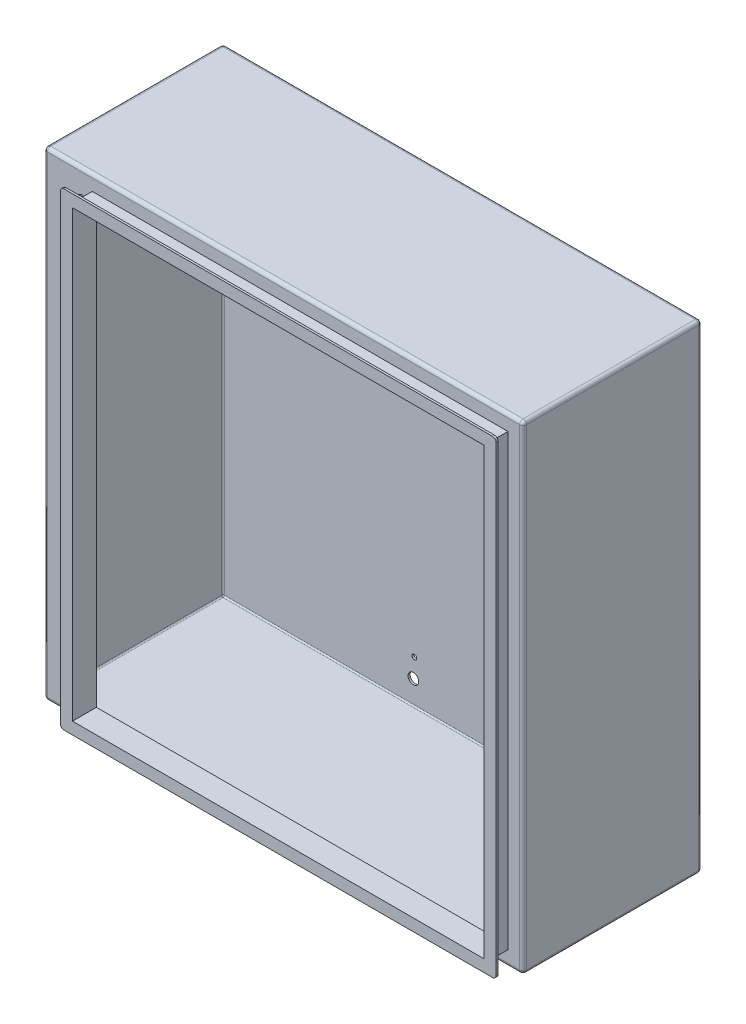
ISO-10303-21;
HEADER;
FILE_DESCRIPTION(('STEP AP214'),'2;1');
FILE_NAME('part.step','',(''),(''),'','','');
FILE_SCHEMA(('AUTOMOTIVE_DESIGN { 1 0 10303 214 1 1 1 1 }'));
ENDSEC;
DATA;
#1=APPLICATION_CONTEXT('core data for automotive mechanical design processes');
#2=APPLICATION_PROTOCOL_DEFINITION('international standard','automotive_design',2000,#1);
#3=PRODUCT_CONTEXT('',#1,'mechanical');
#4=PRODUCT('Part','Part','',(#3));
#5=PRODUCT_RELATED_PRODUCT_CATEGORY('part','',(#4));
#6=PRODUCT_DEFINITION_FORMATION('','',#4);
#7=PRODUCT_DEFINITION_CONTEXT('part definition',#1,'design');
#8=PRODUCT_DEFINITION('design','',#6,#7);
#9=PRODUCT_DEFINITION_SHAPE('','',#8);
#10=(LENGTH_UNIT() NAMED_UNIT(*) SI_UNIT(.MILLI.,.METRE.));
#11=(NAMED_UNIT(*) PLANE_ANGLE_UNIT() SI_UNIT($,.RADIAN.));
#12=(NAMED_UNIT(*) SI_UNIT($,.STERADIAN.) SOLID_ANGLE_UNIT());
#13=UNCERTAINTY_MEASURE_WITH_UNIT(LENGTH_MEASURE(1.E-05),#10,'distance_accuracy_value','');
#14=(GEOMETRIC_REPRESENTATION_CONTEXT(3) GLOBAL_UNCERTAINTY_ASSIGNED_CONTEXT((#13)) GLOBAL_UNIT_ASSIGNED_CONTEXT((#10,
#11,#12)) REPRESENTATION_CONTEXT('',''));
#15=CARTESIAN_POINT('',(0.,0.,0.));
#16=DIRECTION('',(0.,0.,1.));
#17=DIRECTION('',(1.,0.,0.));
#18=AXIS2_PLACEMENT_3D('',#15,#16,#17);
#19=CARTESIAN_POINT('',(-176.276,177.8,132.842));
#20=DIRECTION('',(1.,0.,0.));
#21=DIRECTION('',(0.,1.,0.));
#22=AXIS2_PLACEMENT_3D('',#19,#20,#21);
#23=PLANE('',#22);
#24=DIRECTION('',(0.,0.,1.));
#25=VECTOR('',#24,1.);
#26=CARTESIAN_POINT('',(-176.276,-175.26,132.842));
#27=LINE('',#26,#25);
#28=CARTESIAN_POINT('',(-176.276,-175.26,2.53999999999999));
#29=VERTEX_POINT('',#28);
#30=CARTESIAN_POINT('',(-176.276,-175.26,130.302));
#31=VERTEX_POINT('',#30);
#32=EDGE_CURVE('E383',#29,#31,#27,.T.);
#33=ORIENTED_EDGE('',*,*,#32,.F.);
#34=DIRECTION('',(0.,1.,0.));
#35=VECTOR('',#34,1.);
#36=CARTESIAN_POINT('',(-176.276,177.8,2.53999999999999));
#37=LINE('',#36,#35);
#38=CARTESIAN_POINT('',(-176.276,175.26,2.53999999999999));
#39=VERTEX_POINT('',#38);
#40=EDGE_CURVE('E386',#39,#29,#37,.F.);
#41=ORIENTED_EDGE('',*,*,#40,.F.);
#42=DIRECTION('',(0.,0.,1.));
#43=VECTOR('',#42,1.);
#44=CARTESIAN_POINT('',(-176.276,175.26,132.842));
#45=LINE('',#44,#43);
#46=CARTESIAN_POINT('',(-176.276,175.26,130.302));
#47=VERTEX_POINT('',#46);
#48=EDGE_CURVE('E390',#47,#39,#45,.F.);
#49=ORIENTED_EDGE('',*,*,#48,.F.);
#50=DIRECTION('',(0.,1.,0.));
#51=VECTOR('',#50,1.);
#52=CARTESIAN_POINT('',(-176.276,177.8,130.302));
#53=LINE('',#52,#51);
#54=EDGE_CURVE('E385',#31,#47,#53,.T.);
#55=ORIENTED_EDGE('',*,*,#54,.F.);
#56=EDGE_LOOP('',(#33,#41,#49,#55));
#57=FACE_BOUND('',#56,.T.);
#58=ADVANCED_FACE('F32',(#57),#23,.T.);
#59=CARTESIAN_POINT('',(-177.8,-176.276,132.842));
#60=DIRECTION('',(0.,1.,0.));
#61=DIRECTION('',(0.,0.,1.));
#62=AXIS2_PLACEMENT_3D('',#59,#60,#61);
#63=PLANE('',#62);
#64=DIRECTION('',(1.,0.,0.));
#65=VECTOR('',#64,1.);
#66=CARTESIAN_POINT('',(-177.8,-176.276,130.302));
#67=LINE('',#66,#65);
#68=CARTESIAN_POINT('',(175.26,-176.276,130.302));
#69=VERTEX_POINT('',#68);
#70=CARTESIAN_POINT('',(-175.26,-176.276,130.302));
#71=VERTEX_POINT('',#70);
#72=EDGE_CURVE('E499',#69,#71,#67,.F.);
#73=ORIENTED_EDGE('',*,*,#72,.F.);
#74=DIRECTION('',(0.,0.,1.));
#75=VECTOR('',#74,1.);
#76=CARTESIAN_POINT('',(175.26,-176.276,132.842));
#77=LINE('',#76,#75);
#78=CARTESIAN_POINT('',(175.26,-176.276,2.53999999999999));
#79=VERTEX_POINT('',#78);
#80=EDGE_CURVE('E459',#79,#69,#77,.T.);
#81=ORIENTED_EDGE('',*,*,#80,.F.);
#82=DIRECTION('',(1.,0.,0.));
#83=VECTOR('',#82,1.);
#84=CARTESIAN_POINT('',(-177.8,-176.276,2.53999999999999));
#85=LINE('',#84,#83);
#86=CARTESIAN_POINT('',(-175.26,-176.276,2.53999999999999));
#87=VERTEX_POINT('',#86);
#88=EDGE_CURVE('E497',#87,#79,#85,.T.);
#89=ORIENTED_EDGE('',*,*,#88,.F.);
#90=DIRECTION('',(0.,0.,1.));
#91=VECTOR('',#90,1.);
#92=CARTESIAN_POINT('',(-175.26,-176.276,132.842));
#93=LINE('',#92,#91);
#94=EDGE_CURVE('E422',#71,#87,#93,.F.);
#95=ORIENTED_EDGE('',*,*,#94,.F.);
#96=EDGE_LOOP('',(#73,#81,#89,#95));
#97=FACE_BOUND('',#96,.T.);
#98=ADVANCED_FACE('F762',(#97),#63,.T.);
#99=CARTESIAN_POINT('',(176.276,177.8,132.842));
#100=DIRECTION('',(-1.,0.,0.));
#101=DIRECTION('',(0.,0.,1.));
#102=AXIS2_PLACEMENT_3D('',#99,#100,#101);
#103=PLANE('',#102);
#104=DIRECTION('',(0.,1.,0.));
#105=VECTOR('',#104,1.);
#106=CARTESIAN_POINT('',(176.276,177.8,130.302));
#107=LINE('',#106,#105);
#108=CARTESIAN_POINT('',(176.276,175.26,130.302));
#109=VERTEX_POINT('',#108);
#110=CARTESIAN_POINT('',(176.276,-175.26,130.302));
#111=VERTEX_POINT('',#110);
#112=EDGE_CURVE('E432',#109,#111,#107,.F.);
#113=ORIENTED_EDGE('',*,*,#112,.F.);
#114=DIRECTION('',(0.,0.,1.));
#115=VECTOR('',#114,1.);
#116=CARTESIAN_POINT('',(176.276,175.26,132.842));
#117=LINE('',#116,#115);
#118=CARTESIAN_POINT('',(176.276,175.26,2.53999999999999));
#119=VERTEX_POINT('',#118);
#120=EDGE_CURVE('E435',#119,#109,#117,.T.);
#121=ORIENTED_EDGE('',*,*,#120,.F.);
#122=DIRECTION('',(0.,1.,0.));
#123=VECTOR('',#122,1.);
#124=CARTESIAN_POINT('',(176.276,177.8,2.53999999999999));
#125=LINE('',#124,#123);
#126=CARTESIAN_POINT('',(176.276,-175.26,2.53999999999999));
#127=VERTEX_POINT('',#126);
#128=EDGE_CURVE('E412',#127,#119,#125,.T.);
#129=ORIENTED_EDGE('',*,*,#128,.F.);
#130=DIRECTION('',(0.,0.,1.));
#131=VECTOR('',#130,1.);
#132=CARTESIAN_POINT('',(176.276,-175.26,132.842));
#133=LINE('',#132,#131);
#134=EDGE_CURVE('E434',#111,#127,#133,.F.);
#135=ORIENTED_EDGE('',*,*,#134,.F.);
#136=EDGE_LOOP('',(#113,#121,#129,#135));
#137=FACE_BOUND('',#136,.T.);
#138=ADVANCED_FACE('F768',(#137),#103,.T.);
#139=CARTESIAN_POINT('',(-177.8,176.276,132.842));
#140=DIRECTION('',(0.,-1.,0.));
#141=DIRECTION('',(0.,0.,-1.));
#142=AXIS2_PLACEMENT_3D('',#139,#140,#141);
#143=PLANE('',#142);
#144=DIRECTION('',(0.,0.,-1.));
#145=VECTOR('',#144,1.);
#146=CARTESIAN_POINT('',(-175.26,176.276,132.842));
#147=LINE('',#146,#145);
#148=CARTESIAN_POINT('',(-175.26,176.276,2.53999999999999));
#149=VERTEX_POINT('',#148);
#150=CARTESIAN_POINT('',(-175.26,176.276,130.302));
#151=VERTEX_POINT('',#150);
#152=EDGE_CURVE('E406',#149,#151,#147,.F.);
#153=ORIENTED_EDGE('',*,*,#152,.F.);
#154=DIRECTION('',(1.,0.,0.));
#155=VECTOR('',#154,1.);
#156=CARTESIAN_POINT('',(-177.8,176.276,2.53999999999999));
#157=LINE('',#156,#155);
#158=CARTESIAN_POINT('',(175.26,176.276,2.53999999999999));
#159=VERTEX_POINT('',#158);
#160=EDGE_CURVE('E409',#159,#149,#157,.F.);
#161=ORIENTED_EDGE('',*,*,#160,.F.);
#162=DIRECTION('',(0.,0.,-1.));
#163=VECTOR('',#162,1.);
#164=CARTESIAN_POINT('',(175.26,176.276,132.842));
#165=LINE('',#164,#163);
#166=CARTESIAN_POINT('',(175.26,176.276,130.302));
#167=VERTEX_POINT('',#166);
#168=EDGE_CURVE('E389',#167,#159,#165,.T.);
#169=ORIENTED_EDGE('',*,*,#168,.F.);
#170=DIRECTION('',(1.,0.,0.));
#171=VECTOR('',#170,1.);
#172=CARTESIAN_POINT('',(-177.8,176.276,130.302));
#173=LINE('',#172,#171);
#174=EDGE_CURVE('E408',#151,#167,#173,.T.);
#175=ORIENTED_EDGE('',*,*,#174,.F.);
#176=EDGE_LOOP('',(#153,#161,#169,#175));
#177=FACE_BOUND('',#176,.T.);
#178=ADVANCED_FACE('F777',(#177),#143,.T.);
#179=CARTESIAN_POINT('',(0.,0.,131.318));
#180=DIRECTION('',(0.,0.,1.));
#181=DIRECTION('',(1.,0.,0.));
#182=AXIS2_PLACEMENT_3D('',#179,#180,#181);
#183=PLANE('',#182);
#184=CARTESIAN_POINT('',(-149.61196134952,157.22409166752,131.318));
#185=DIRECTION('',(0.,0.,1.));
#186=DIRECTION('',(1.,0.,0.));
#187=AXIS2_PLACEMENT_3D('',#184,#185,#186);
#188=CIRCLE('',#187,3.373501);
#189=CARTESIAN_POINT('',(-146.23846034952,157.22409166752,131.318));
#190=VERTEX_POINT('',#189);
#191=EDGE_CURVE('E1602',#190,#190,#188,.T.);
#192=ORIENTED_EDGE('',*,*,#191,.T.);
#193=EDGE_LOOP('',(#192));
#194=FACE_BOUND('',#193,.T.);
#195=CARTESIAN_POINT('',(-149.61196134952,115.31409166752,131.318));
#196=DIRECTION('',(0.,0.,1.));
#197=DIRECTION('',(1.,0.,0.));
#198=AXIS2_PLACEMENT_3D('',#195,#196,#197);
#199=CIRCLE('',#198,3.373501);
#200=CARTESIAN_POINT('',(-146.23846034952,115.31409166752,131.318));
#201=VERTEX_POINT('',#200);
#202=EDGE_CURVE('E1612',#201,#201,#199,.T.);
#203=ORIENTED_EDGE('',*,*,#202,.T.);
#204=EDGE_LOOP('',(#203));
#205=FACE_BOUND('',#204,.T.);
#206=CARTESIAN_POINT('',(-149.61196134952,-115.31790833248,131.318));
#207=DIRECTION('',(0.,0.,1.));
#208=DIRECTION('',(1.,0.,0.));
#209=AXIS2_PLACEMENT_3D('',#206,#207,#208);
#210=CIRCLE('',#209,3.373501);
#211=CARTESIAN_POINT('',(-146.23846034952,-115.31790833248,131.318));
#212=VERTEX_POINT('',#211);
#213=EDGE_CURVE('E1618',#212,#212,#210,.T.);
#214=ORIENTED_EDGE('',*,*,#213,.T.);
#215=EDGE_LOOP('',(#214));
#216=FACE_BOUND('',#215,.T.);
#217=CARTESIAN_POINT('',(-149.61196134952,-157.22790833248,131.318));
#218=DIRECTION('',(0.,0.,1.));
#219=DIRECTION('',(1.,0.,0.));
#220=AXIS2_PLACEMENT_3D('',#217,#218,#219);
#221=CIRCLE('',#220,3.373501);
#222=CARTESIAN_POINT('',(-146.23846034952,-157.22790833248,131.318));
#223=VERTEX_POINT('',#222);
#224=EDGE_CURVE('E1624',#223,#223,#221,.T.);
#225=ORIENTED_EDGE('',*,*,#224,.T.);
#226=EDGE_LOOP('',(#225));
#227=FACE_BOUND('',#226,.T.);
#228=DIRECTION('',(0.,1.,0.));
#229=VECTOR('',#228,1.);
#230=CARTESIAN_POINT('',(-175.26,0.,131.318));
#231=LINE('',#230,#229);
#232=CARTESIAN_POINT('',(-175.26,175.26,131.318));
#233=VERTEX_POINT('',#232);
#234=CARTESIAN_POINT('',(-175.26,-175.26,131.318));
#235=VERTEX_POINT('',#234);
#236=EDGE_CURVE('E453',#233,#235,#231,.F.);
#237=ORIENTED_EDGE('',*,*,#236,.F.);
#238=DIRECTION('',(1.,0.,0.));
#239=VECTOR('',#238,1.);
#240=CARTESIAN_POINT('',(0.,175.26,131.318));
#241=LINE('',#240,#239);
#242=CARTESIAN_POINT('',(175.26,175.26,131.318));
#243=VERTEX_POINT('',#242);
#244=EDGE_CURVE('E451',#243,#233,#241,.F.);
#245=ORIENTED_EDGE('',*,*,#244,.F.);
#246=DIRECTION('',(0.,1.,0.));
#247=VECTOR('',#246,1.);
#248=CARTESIAN_POINT('',(175.26,0.,131.318));
#249=LINE('',#248,#247);
#250=CARTESIAN_POINT('',(175.26,-175.26,131.318));
#251=VERTEX_POINT('',#250);
#252=EDGE_CURVE('E454',#251,#243,#249,.T.);
#253=ORIENTED_EDGE('',*,*,#252,.F.);
#254=DIRECTION('',(1.,0.,0.));
#255=VECTOR('',#254,1.);
#256=CARTESIAN_POINT('',(0.,-175.26,131.318));
#257=LINE('',#256,#255);
#258=EDGE_CURVE('E456',#235,#251,#257,.T.);
#259=ORIENTED_EDGE('',*,*,#258,.F.);
#260=EDGE_LOOP('',(#237,#245,#253,#259));
#261=FACE_BOUND('',#260,.T.);
#262=DIRECTION('',(0.,-1.,0.));
#263=VECTOR('',#262,1.);
#264=CARTESIAN_POINT('',(-140.462,166.624,131.318));
#265=LINE('',#264,#263);
#266=CARTESIAN_POINT('',(-140.462,165.1,131.318));
#267=VERTEX_POINT('',#266);
#268=CARTESIAN_POINT('',(-140.462,-165.1,131.318));
#269=VERTEX_POINT('',#268);
#270=EDGE_CURVE('E402',#267,#269,#265,.T.);
#271=ORIENTED_EDGE('',*,*,#270,.T.);
#272=DIRECTION('',(1.,0.,0.));
#273=VECTOR('',#272,1.);
#274=CARTESIAN_POINT('',(-141.986,-165.1,131.318));
#275=LINE('',#274,#273);
#276=CARTESIAN_POINT('',(165.1,-165.1,131.318));
#277=VERTEX_POINT('',#276);
#278=EDGE_CURVE('E464',#269,#277,#275,.T.);
#279=ORIENTED_EDGE('',*,*,#278,.T.);
#280=DIRECTION('',(0.,1.,0.));
#281=VECTOR('',#280,1.);
#282=CARTESIAN_POINT('',(165.1,166.624,131.318));
#283=LINE('',#282,#281);
#284=CARTESIAN_POINT('',(165.1,165.1,131.318));
#285=VERTEX_POINT('',#284);
#286=EDGE_CURVE('E469',#277,#285,#283,.T.);
#287=ORIENTED_EDGE('',*,*,#286,.T.);
#288=DIRECTION('',(-1.,0.,0.));
#289=VECTOR('',#288,1.);
#290=CARTESIAN_POINT('',(-141.986,165.1,131.318));
#291=LINE('',#290,#289);
#292=EDGE_CURVE('E465',#285,#267,#291,.T.);
#293=ORIENTED_EDGE('',*,*,#292,.T.);
#294=EDGE_LOOP('',(#271,#279,#287,#293));
#295=FACE_BOUND('',#294,.T.);
#296=ADVANCED_FACE('F781',(#194,#205,#216,#227,#261,#295),#183,.F.);
#297=CARTESIAN_POINT('',(0.,0.,1.524));
#298=DIRECTION('',(0.,0.,1.));
#299=DIRECTION('',(1.,0.,0.));
#300=AXIS2_PLACEMENT_3D('',#297,#298,#299);
#301=PLANE('',#300);
#302=CARTESIAN_POINT('',(34.91903865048,158.74182662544,1.524));
#303=DIRECTION('',(0.,0.,1.));
#304=DIRECTION('',(1.,0.,0.));
#305=AXIS2_PLACEMENT_3D('',#302,#303,#304);
#306=CIRCLE('',#305,3.96239999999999);
#307=CARTESIAN_POINT('',(38.88143865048,158.74182662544,1.524));
#308=VERTEX_POINT('',#307);
#309=EDGE_CURVE('E1627',#308,#308,#306,.F.);
#310=ORIENTED_EDGE('',*,*,#309,.T.);
#311=EDGE_LOOP('',(#310));
#312=FACE_BOUND('',#311,.T.);
#313=CARTESIAN_POINT('',(-34.9309613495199,158.75435671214,1.524));
#314=DIRECTION('',(0.,0.,1.));
#315=DIRECTION('',(1.,0.,0.));
#316=AXIS2_PLACEMENT_3D('',#313,#314,#315);
#317=CIRCLE('',#316,3.96239999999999);
#318=CARTESIAN_POINT('',(-30.9685613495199,158.75435671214,1.524));
#319=VERTEX_POINT('',#318);
#320=EDGE_CURVE('E1667',#319,#319,#317,.F.);
#321=ORIENTED_EDGE('',*,*,#320,.T.);
#322=EDGE_LOOP('',(#321));
#323=FACE_BOUND('',#322,.T.);
#324=CARTESIAN_POINT('',(34.15703865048,93.22958535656,1.524));
#325=DIRECTION('',(0.,0.,1.));
#326=DIRECTION('',(1.,0.,0.));
#327=AXIS2_PLACEMENT_3D('',#324,#325,#326);
#328=CIRCLE('',#327,1.75259999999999);
#329=CARTESIAN_POINT('',(35.90963865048,93.22958535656,1.524));
#330=VERTEX_POINT('',#329);
#331=EDGE_CURVE('E1661',#330,#330,#328,.F.);
#332=ORIENTED_EDGE('',*,*,#331,.T.);
#333=EDGE_LOOP('',(#332));
#334=FACE_BOUND('',#333,.T.);
#335=CARTESIAN_POINT('',(-34.16896134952,93.22958535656,1.524));
#336=DIRECTION('',(0.,0.,1.));
#337=DIRECTION('',(1.,0.,0.));
#338=AXIS2_PLACEMENT_3D('',#335,#336,#337);
#339=CIRCLE('',#338,1.75259999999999);
#340=CARTESIAN_POINT('',(-32.41636134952,93.22958535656,1.524));
#341=VERTEX_POINT('',#340);
#342=EDGE_CURVE('E1655',#341,#341,#339,.F.);
#343=ORIENTED_EDGE('',*,*,#342,.T.);
#344=EDGE_LOOP('',(#343));
#345=FACE_BOUND('',#344,.T.);
#346=CARTESIAN_POINT('',(34.15703865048,-144.51486366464,1.524));
#347=DIRECTION('',(0.,0.,1.));
#348=DIRECTION('',(1.,0.,0.));
#349=AXIS2_PLACEMENT_3D('',#346,#347,#348);
#350=CIRCLE('',#349,1.75259999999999);
#351=CARTESIAN_POINT('',(35.90963865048,-144.51486366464,1.524));
#352=VERTEX_POINT('',#351);
#353=EDGE_CURVE('E1649',#352,#352,#350,.F.);
#354=ORIENTED_EDGE('',*,*,#353,.T.);
#355=EDGE_LOOP('',(#354));
#356=FACE_BOUND('',#355,.T.);
#357=CARTESIAN_POINT('',(34.91903865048,-158.75817337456,1.524));
#358=DIRECTION('',(0.,0.,1.));
#359=DIRECTION('',(1.,0.,0.));
#360=AXIS2_PLACEMENT_3D('',#357,#358,#359);
#361=CIRCLE('',#360,3.96239999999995);
#362=CARTESIAN_POINT('',(38.88143865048,-158.75817337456,1.524));
#363=VERTEX_POINT('',#362);
#364=EDGE_CURVE('E1643',#363,#363,#361,.F.);
#365=ORIENTED_EDGE('',*,*,#364,.T.);
#366=EDGE_LOOP('',(#365));
#367=FACE_BOUND('',#366,.T.);
#368=CARTESIAN_POINT('',(-34.9309613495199,-158.75817337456,1.524));
#369=DIRECTION('',(0.,0.,1.));
#370=DIRECTION('',(1.,0.,0.));
#371=AXIS2_PLACEMENT_3D('',#368,#369,#370);
#372=CIRCLE('',#371,3.96239999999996);
#373=CARTESIAN_POINT('',(-30.96856134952,-158.75817337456,1.524));
#374=VERTEX_POINT('',#373);
#375=EDGE_CURVE('E1637',#374,#374,#372,.F.);
#376=ORIENTED_EDGE('',*,*,#375,.T.);
#377=EDGE_LOOP('',(#376));
#378=FACE_BOUND('',#377,.T.);
#379=CARTESIAN_POINT('',(-34.16896134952,-144.51486366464,1.524));
#380=DIRECTION('',(0.,0.,1.));
#381=DIRECTION('',(1.,0.,0.));
#382=AXIS2_PLACEMENT_3D('',#379,#380,#381);
#383=CIRCLE('',#382,1.75259999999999);
#384=CARTESIAN_POINT('',(-32.41636134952,-144.51486366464,1.524));
#385=VERTEX_POINT('',#384);
#386=EDGE_CURVE('E1631',#385,#385,#383,.F.);
#387=ORIENTED_EDGE('',*,*,#386,.T.);
#388=EDGE_LOOP('',(#387));
#389=FACE_BOUND('',#388,.T.);
#390=CARTESIAN_POINT('',(-0.00596134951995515,139.058583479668,1.524));
#391=DIRECTION('',(0.,0.,1.));
#392=DIRECTION('',(1.,0.,0.));
#393=AXIS2_PLACEMENT_3D('',#390,#391,#392);
#394=CIRCLE('',#393,17.78);
#395=CARTESIAN_POINT('',(-17.7838544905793,138.784876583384,1.524));
#396=VERTEX_POINT('',#395);
#397=CARTESIAN_POINT('',(17.7719317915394,138.784876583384,1.524));
#398=VERTEX_POINT('',#397);
#399=EDGE_CURVE('E322',#396,#398,#394,.F.);
#400=ORIENTED_EDGE('',*,*,#399,.T.);
#401=CARTESIAN_POINT('',(-0.00596134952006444,120.64358347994,1.524));
#402=DIRECTION('',(0.,0.,1.));
#403=DIRECTION('',(1.,0.,0.));
#404=AXIS2_PLACEMENT_3D('',#401,#402,#403);
#405=CIRCLE('',#404,25.4000000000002);
#406=CARTESIAN_POINT('',(17.7719317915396,102.502290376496,1.524));
#407=VERTEX_POINT('',#406);
#408=EDGE_CURVE('E311',#398,#407,#405,.F.);
#409=ORIENTED_EDGE('',*,*,#408,.T.);
#410=CARTESIAN_POINT('',(-0.00596134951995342,102.228583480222,1.524));
#411=DIRECTION('',(0.,0.,1.));
#412=DIRECTION('',(1.,0.,0.));
#413=AXIS2_PLACEMENT_3D('',#410,#411,#412);
#414=CIRCLE('',#413,17.78);
#415=CARTESIAN_POINT('',(-17.7838544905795,102.502290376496,1.524));
#416=VERTEX_POINT('',#415);
#417=EDGE_CURVE('E333',#407,#416,#414,.F.);
#418=ORIENTED_EDGE('',*,*,#417,.T.);
#419=CARTESIAN_POINT('',(-0.00596134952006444,120.64358347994,1.524));
#420=DIRECTION('',(0.,0.,1.));
#421=DIRECTION('',(1.,0.,0.));
#422=AXIS2_PLACEMENT_3D('',#419,#420,#421);
#423=CIRCLE('',#422,25.4);
#424=EDGE_CURVE('E329',#416,#396,#423,.F.);
#425=ORIENTED_EDGE('',*,*,#424,.T.);
#426=EDGE_LOOP('',(#400,#409,#418,#425));
#427=FACE_BOUND('',#426,.T.);
#428=DIRECTION('',(0.,1.,0.));
#429=VECTOR('',#428,1.);
#430=CARTESIAN_POINT('',(175.26,0.,1.524));
#431=LINE('',#430,#429);
#432=CARTESIAN_POINT('',(175.26,175.26,1.524));
#433=VERTEX_POINT('',#432);
#434=CARTESIAN_POINT('',(175.26,-175.26,1.524));
#435=VERTEX_POINT('',#434);
#436=EDGE_CURVE('E420',#433,#435,#431,.F.);
#437=ORIENTED_EDGE('',*,*,#436,.F.);
#438=DIRECTION('',(1.,0.,0.));
#439=VECTOR('',#438,1.);
#440=CARTESIAN_POINT('',(0.,175.26,1.524));
#441=LINE('',#440,#439);
#442=CARTESIAN_POINT('',(-175.26,175.26,1.524));
#443=VERTEX_POINT('',#442);
#444=EDGE_CURVE('E417',#443,#433,#441,.T.);
#445=ORIENTED_EDGE('',*,*,#444,.F.);
#446=DIRECTION('',(0.,1.,0.));
#447=VECTOR('',#446,1.);
#448=CARTESIAN_POINT('',(-175.26,0.,1.524));
#449=LINE('',#448,#447);
#450=CARTESIAN_POINT('',(-175.26,-175.26,1.524));
#451=VERTEX_POINT('',#450);
#452=EDGE_CURVE('E419',#451,#443,#449,.T.);
#453=ORIENTED_EDGE('',*,*,#452,.F.);
#454=DIRECTION('',(1.,0.,0.));
#455=VECTOR('',#454,1.);
#456=CARTESIAN_POINT('',(0.,-175.26,1.524));
#457=LINE('',#456,#455);
#458=EDGE_CURVE('E392',#435,#451,#457,.F.);
#459=ORIENTED_EDGE('',*,*,#458,.F.);
#460=EDGE_LOOP('',(#437,#445,#453,#459));
#461=FACE_BOUND('',#460,.T.);
#462=ADVANCED_FACE('F327',(#312,#323,#334,#345,#356,#367,#378,#389,#427,#461),#301,.T.);
#463=CARTESIAN_POINT('',(-140.462,166.624,147.574));
#464=DIRECTION('',(1.,0.,0.));
#465=DIRECTION('',(0.,1.,0.));
#466=AXIS2_PLACEMENT_3D('',#463,#464,#465);
#467=PLANE('',#466);
#468=ORIENTED_EDGE('',*,*,#270,.F.);
#469=DIRECTION('',(0.,0.,-1.));
#470=VECTOR('',#469,1.);
#471=CARTESIAN_POINT('',(-140.462,165.1,147.574));
#472=LINE('',#471,#470);
#473=CARTESIAN_POINT('',(-140.462,165.1,149.098));
#474=VERTEX_POINT('',#473);
#475=EDGE_CURVE('E468',#474,#267,#472,.T.);
#476=ORIENTED_EDGE('',*,*,#475,.F.);
#477=DIRECTION('',(0.,-1.,0.));
#478=VECTOR('',#477,1.);
#479=CARTESIAN_POINT('',(-140.462,165.1,149.098));
#480=LINE('',#479,#478);
#481=CARTESIAN_POINT('',(-140.462,-165.1,149.098));
#482=VERTEX_POINT('',#481);
#483=EDGE_CURVE('E355',#474,#482,#480,.T.);
#484=ORIENTED_EDGE('',*,*,#483,.T.);
#485=DIRECTION('',(0.,0.,-1.));
#486=VECTOR('',#485,1.);
#487=CARTESIAN_POINT('',(-140.462,-165.1,147.574));
#488=LINE('',#487,#486);
#489=EDGE_CURVE('E461',#482,#269,#488,.T.);
#490=ORIENTED_EDGE('',*,*,#489,.T.);
#491=EDGE_LOOP('',(#468,#476,#484,#490));
#492=FACE_BOUND('',#491,.T.);
#493=ADVANCED_FACE('F788',(#492),#467,.T.);
#494=CARTESIAN_POINT('',(-141.986,-165.1,147.574));
#495=DIRECTION('',(0.,1.,0.));
#496=DIRECTION('',(0.,0.,1.));
#497=AXIS2_PLACEMENT_3D('',#494,#495,#496);
#498=PLANE('',#497);
#499=ORIENTED_EDGE('',*,*,#278,.F.);
#500=ORIENTED_EDGE('',*,*,#489,.F.);
#501=DIRECTION('',(1.,0.,0.));
#502=VECTOR('',#501,1.);
#503=CARTESIAN_POINT('',(-140.462,-165.1,149.098));
#504=LINE('',#503,#502);
#505=CARTESIAN_POINT('',(165.1,-165.1,149.098));
#506=VERTEX_POINT('',#505);
#507=EDGE_CURVE('E318',#482,#506,#504,.T.);
#508=ORIENTED_EDGE('',*,*,#507,.T.);
#509=DIRECTION('',(0.,0.,-1.));
#510=VECTOR('',#509,1.);
#511=CARTESIAN_POINT('',(165.1,-165.1,147.574));
#512=LINE('',#511,#510);
#513=EDGE_CURVE('E476',#506,#277,#512,.T.);
#514=ORIENTED_EDGE('',*,*,#513,.T.);
#515=EDGE_LOOP('',(#499,#500,#508,#514));
#516=FACE_BOUND('',#515,.T.);
#517=ADVANCED_FACE('F792',(#516),#498,.T.);
#518=CARTESIAN_POINT('',(165.1,166.624,147.574));
#519=DIRECTION('',(-1.,0.,0.));
#520=DIRECTION('',(0.,-1.,0.));
#521=AXIS2_PLACEMENT_3D('',#518,#519,#520);
#522=PLANE('',#521);
#523=ORIENTED_EDGE('',*,*,#286,.F.);
#524=ORIENTED_EDGE('',*,*,#513,.F.);
#525=DIRECTION('',(0.,1.,0.));
#526=VECTOR('',#525,1.);
#527=CARTESIAN_POINT('',(165.1,-165.1,149.098));
#528=LINE('',#527,#526);
#529=CARTESIAN_POINT('',(165.1,165.1,149.098));
#530=VERTEX_POINT('',#529);
#531=EDGE_CURVE('E349',#506,#530,#528,.T.);
#532=ORIENTED_EDGE('',*,*,#531,.T.);
#533=DIRECTION('',(0.,0.,-1.));
#534=VECTOR('',#533,1.);
#535=CARTESIAN_POINT('',(165.1,165.1,147.574));
#536=LINE('',#535,#534);
#537=EDGE_CURVE('E479',#530,#285,#536,.T.);
#538=ORIENTED_EDGE('',*,*,#537,.T.);
#539=EDGE_LOOP('',(#523,#524,#532,#538));
#540=FACE_BOUND('',#539,.T.);
#541=ADVANCED_FACE('F796',(#540),#522,.T.);
#542=CARTESIAN_POINT('',(-141.986,165.1,147.574));
#543=DIRECTION('',(0.,-1.,0.));
#544=DIRECTION('',(0.,0.,-1.));
#545=AXIS2_PLACEMENT_3D('',#542,#543,#544);
#546=PLANE('',#545);
#547=ORIENTED_EDGE('',*,*,#292,.F.);
#548=ORIENTED_EDGE('',*,*,#537,.F.);
#549=DIRECTION('',(-1.,0.,0.));
#550=VECTOR('',#549,1.);
#551=CARTESIAN_POINT('',(165.1,165.1,149.098));
#552=LINE('',#551,#550);
#553=EDGE_CURVE('E352',#530,#474,#552,.T.);
#554=ORIENTED_EDGE('',*,*,#553,.T.);
#555=ORIENTED_EDGE('',*,*,#475,.T.);
#556=EDGE_LOOP('',(#547,#548,#554,#555));
#557=FACE_BOUND('',#556,.T.);
#558=ADVANCED_FACE('F800',(#557),#546,.T.);
#559=CARTESIAN_POINT('',(-177.8,175.26,2.53999999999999));
#560=DIRECTION('',(-1.,0.,0.));
#561=DIRECTION('',(0.,0.,1.));
#562=AXIS2_PLACEMENT_3D('',#559,#560,#561);
#563=CYLINDRICAL_SURFACE('',#562,1.016);
#564=CARTESIAN_POINT('',(-175.26,175.26,2.54));
#565=DIRECTION('',(1.,0.,0.));
#566=DIRECTION('',(0.,1.,0.));
#567=AXIS2_PLACEMENT_3D('',#564,#565,#566);
#568=CIRCLE('',#567,1.016);
#569=EDGE_CURVE('E399',#149,#443,#568,.F.);
#570=ORIENTED_EDGE('',*,*,#569,.T.);
#571=ORIENTED_EDGE('',*,*,#444,.T.);
#572=CARTESIAN_POINT('',(175.26,175.26,2.54));
#573=DIRECTION('',(1.,0.,0.));
#574=DIRECTION('',(0.,1.,0.));
#575=AXIS2_PLACEMENT_3D('',#572,#573,#574);
#576=CIRCLE('',#575,1.016);
#577=EDGE_CURVE('E403',#433,#159,#576,.T.);
#578=ORIENTED_EDGE('',*,*,#577,.T.);
#579=ORIENTED_EDGE('',*,*,#160,.T.);
#580=EDGE_LOOP('',(#570,#571,#578,#579));
#581=FACE_BOUND('',#580,.T.);
#582=ADVANCED_FACE('F804',(#581),#563,.F.);
#583=CARTESIAN_POINT('',(-175.26,175.26,2.54));
#584=DIRECTION('',(0.,0.,1.));
#585=DIRECTION('',(1.,0.,0.));
#586=AXIS2_PLACEMENT_3D('',#583,#584,#585);
#587=SPHERICAL_SURFACE('',#586,1.016);
#588=CARTESIAN_POINT('',(-175.26,175.26,2.53999999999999));
#589=DIRECTION('',(0.,0.,-1.));
#590=DIRECTION('',(-1.,0.,0.));
#591=AXIS2_PLACEMENT_3D('',#588,#589,#590);
#592=CIRCLE('',#591,1.016);
#593=EDGE_CURVE('E394',#149,#39,#592,.F.);
#594=ORIENTED_EDGE('',*,*,#593,.T.);
#595=CARTESIAN_POINT('',(-175.26,175.26,2.53999999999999));
#596=DIRECTION('',(0.,-1.,0.));
#597=DIRECTION('',(1.,0.,0.));
#598=AXIS2_PLACEMENT_3D('',#595,#596,#597);
#599=CIRCLE('',#598,1.016);
#600=EDGE_CURVE('E397',#39,#443,#599,.T.);
#601=ORIENTED_EDGE('',*,*,#600,.T.);
#602=ORIENTED_EDGE('',*,*,#569,.F.);
#603=EDGE_LOOP('',(#594,#601,#602));
#604=FACE_BOUND('',#603,.T.);
#605=ADVANCED_FACE('F808',(#604),#587,.F.);
#606=CARTESIAN_POINT('',(175.26,175.26,2.54));
#607=DIRECTION('',(0.,0.,1.));
#608=DIRECTION('',(1.,0.,0.));
#609=AXIS2_PLACEMENT_3D('',#606,#607,#608);
#610=SPHERICAL_SURFACE('',#609,1.016);
#611=CARTESIAN_POINT('',(175.26,175.26,2.53999999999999));
#612=DIRECTION('',(0.,1.,0.));
#613=DIRECTION('',(0.,0.,1.));
#614=AXIS2_PLACEMENT_3D('',#611,#612,#613);
#615=CIRCLE('',#614,1.016);
#616=EDGE_CURVE('E426',#433,#119,#615,.F.);
#617=ORIENTED_EDGE('',*,*,#616,.T.);
#618=CARTESIAN_POINT('',(175.26,175.26,2.53999999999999));
#619=DIRECTION('',(0.,0.,-1.));
#620=DIRECTION('',(-1.,0.,0.));
#621=AXIS2_PLACEMENT_3D('',#618,#619,#620);
#622=CIRCLE('',#621,1.016);
#623=EDGE_CURVE('E398',#119,#159,#622,.F.);
#624=ORIENTED_EDGE('',*,*,#623,.T.);
#625=ORIENTED_EDGE('',*,*,#577,.F.);
#626=EDGE_LOOP('',(#617,#624,#625));
#627=FACE_BOUND('',#626,.T.);
#628=ADVANCED_FACE('F812',(#627),#610,.F.);
#629=CARTESIAN_POINT('',(-175.26,177.8,2.53999999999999));
#630=DIRECTION('',(0.,-1.,0.));
#631=DIRECTION('',(1.,0.,0.));
#632=AXIS2_PLACEMENT_3D('',#629,#630,#631);
#633=CYLINDRICAL_SURFACE('',#632,1.016);
#634=ORIENTED_EDGE('',*,*,#600,.F.);
#635=ORIENTED_EDGE('',*,*,#40,.T.);
#636=CARTESIAN_POINT('',(-175.26,-175.26,2.54));
#637=DIRECTION('',(0.,1.,0.));
#638=DIRECTION('',(-1.,0.,0.));
#639=AXIS2_PLACEMENT_3D('',#636,#637,#638);
#640=CIRCLE('',#639,1.016);
#641=EDGE_CURVE('E486',#29,#451,#640,.F.);
#642=ORIENTED_EDGE('',*,*,#641,.T.);
#643=ORIENTED_EDGE('',*,*,#452,.T.);
#644=EDGE_LOOP('',(#634,#635,#642,#643));
#645=FACE_BOUND('',#644,.T.);
#646=ADVANCED_FACE('F816',(#645),#633,.F.);
#647=CARTESIAN_POINT('',(-175.26,175.26,132.842));
#648=DIRECTION('',(0.,0.,-1.));
#649=DIRECTION('',(-1.,0.,0.));
#650=AXIS2_PLACEMENT_3D('',#647,#648,#649);
#651=CYLINDRICAL_SURFACE('',#650,1.016);
#652=ORIENTED_EDGE('',*,*,#593,.F.);
#653=ORIENTED_EDGE('',*,*,#152,.T.);
#654=CARTESIAN_POINT('',(-175.26,175.26,130.302));
#655=DIRECTION('',(0.,0.,1.));
#656=DIRECTION('',(1.,0.,0.));
#657=AXIS2_PLACEMENT_3D('',#654,#655,#656);
#658=CIRCLE('',#657,1.016);
#659=EDGE_CURVE('E450',#151,#47,#658,.T.);
#660=ORIENTED_EDGE('',*,*,#659,.T.);
#661=ORIENTED_EDGE('',*,*,#48,.T.);
#662=EDGE_LOOP('',(#652,#653,#660,#661));
#663=FACE_BOUND('',#662,.T.);
#664=ADVANCED_FACE('F820',(#663),#651,.F.);
#665=CARTESIAN_POINT('',(0.,175.26,130.302));
#666=DIRECTION('',(1.,0.,0.));
#667=DIRECTION('',(0.,0.,-1.));
#668=AXIS2_PLACEMENT_3D('',#665,#666,#667);
#669=CYLINDRICAL_SURFACE('',#668,1.016);
#670=CARTESIAN_POINT('',(175.26,175.26,130.302));
#671=DIRECTION('',(1.,0.,0.));
#672=DIRECTION('',(0.,1.,0.));
#673=AXIS2_PLACEMENT_3D('',#670,#671,#672);
#674=CIRCLE('',#673,1.016);
#675=EDGE_CURVE('E443',#167,#243,#674,.T.);
#676=ORIENTED_EDGE('',*,*,#675,.T.);
#677=ORIENTED_EDGE('',*,*,#244,.T.);
#678=CARTESIAN_POINT('',(-175.26,175.26,130.302));
#679=DIRECTION('',(1.,0.,0.));
#680=DIRECTION('',(0.,1.,0.));
#681=AXIS2_PLACEMENT_3D('',#678,#679,#680);
#682=CIRCLE('',#681,1.016);
#683=EDGE_CURVE('E447',#233,#151,#682,.F.);
#684=ORIENTED_EDGE('',*,*,#683,.T.);
#685=ORIENTED_EDGE('',*,*,#174,.T.);
#686=EDGE_LOOP('',(#676,#677,#684,#685));
#687=FACE_BOUND('',#686,.T.);
#688=ADVANCED_FACE('F824',(#687),#669,.F.);
#689=CARTESIAN_POINT('',(175.26,175.26,132.842));
#690=DIRECTION('',(0.,0.,-1.));
#691=DIRECTION('',(-1.,0.,0.));
#692=AXIS2_PLACEMENT_3D('',#689,#690,#691);
#693=CYLINDRICAL_SURFACE('',#692,1.016);
#694=ORIENTED_EDGE('',*,*,#623,.F.);
#695=ORIENTED_EDGE('',*,*,#120,.T.);
#696=CARTESIAN_POINT('',(175.26,175.26,130.302));
#697=DIRECTION('',(0.,0.,1.));
#698=DIRECTION('',(1.,0.,0.));
#699=AXIS2_PLACEMENT_3D('',#696,#697,#698);
#700=CIRCLE('',#699,1.016);
#701=EDGE_CURVE('E441',#109,#167,#700,.T.);
#702=ORIENTED_EDGE('',*,*,#701,.T.);
#703=ORIENTED_EDGE('',*,*,#168,.T.);
#704=EDGE_LOOP('',(#694,#695,#702,#703));
#705=FACE_BOUND('',#704,.T.);
#706=ADVANCED_FACE('F828',(#705),#693,.F.);
#707=CARTESIAN_POINT('',(175.26,177.8,2.53999999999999));
#708=DIRECTION('',(0.,1.,0.));
#709=DIRECTION('',(0.,0.,1.));
#710=AXIS2_PLACEMENT_3D('',#707,#708,#709);
#711=CYLINDRICAL_SURFACE('',#710,1.016);
#712=ORIENTED_EDGE('',*,*,#616,.F.);
#713=ORIENTED_EDGE('',*,*,#436,.T.);
#714=CARTESIAN_POINT('',(175.26,-175.26,2.54));
#715=DIRECTION('',(0.,-1.,0.));
#716=DIRECTION('',(0.,0.,-1.));
#717=AXIS2_PLACEMENT_3D('',#714,#715,#716);
#718=CIRCLE('',#717,1.016);
#719=EDGE_CURVE('E444',#435,#127,#718,.T.);
#720=ORIENTED_EDGE('',*,*,#719,.T.);
#721=ORIENTED_EDGE('',*,*,#128,.T.);
#722=EDGE_LOOP('',(#712,#713,#720,#721));
#723=FACE_BOUND('',#722,.T.);
#724=ADVANCED_FACE('F832',(#723),#711,.F.);
#725=CARTESIAN_POINT('',(-177.8,-175.26,2.53999999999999));
#726=DIRECTION('',(1.,0.,0.));
#727=DIRECTION('',(0.,0.,-1.));
#728=AXIS2_PLACEMENT_3D('',#725,#726,#727);
#729=CYLINDRICAL_SURFACE('',#728,1.016);
#730=CARTESIAN_POINT('',(-175.26,-175.26,2.54));
#731=DIRECTION('',(-1.,0.,0.));
#732=DIRECTION('',(0.,-1.,0.));
#733=AXIS2_PLACEMENT_3D('',#730,#731,#732);
#734=CIRCLE('',#733,1.016);
#735=EDGE_CURVE('E429',#451,#87,#734,.T.);
#736=ORIENTED_EDGE('',*,*,#735,.T.);
#737=ORIENTED_EDGE('',*,*,#88,.T.);
#738=CARTESIAN_POINT('',(175.26,-175.26,2.54));
#739=DIRECTION('',(-1.,0.,0.));
#740=DIRECTION('',(0.,-1.,0.));
#741=AXIS2_PLACEMENT_3D('',#738,#739,#740);
#742=CIRCLE('',#741,1.016);
#743=EDGE_CURVE('E494',#79,#435,#742,.F.);
#744=ORIENTED_EDGE('',*,*,#743,.T.);
#745=ORIENTED_EDGE('',*,*,#458,.T.);
#746=EDGE_LOOP('',(#736,#737,#744,#745));
#747=FACE_BOUND('',#746,.T.);
#748=ADVANCED_FACE('F836',(#747),#729,.F.);
#749=CARTESIAN_POINT('',(-175.26,-175.26,2.54));
#750=DIRECTION('',(0.,0.,1.));
#751=DIRECTION('',(1.,0.,0.));
#752=AXIS2_PLACEMENT_3D('',#749,#750,#751);
#753=SPHERICAL_SURFACE('',#752,1.016);
#754=ORIENTED_EDGE('',*,*,#641,.F.);
#755=CARTESIAN_POINT('',(-175.26,-175.26,2.53999999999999));
#756=DIRECTION('',(0.,0.,-1.));
#757=DIRECTION('',(-1.,0.,0.));
#758=AXIS2_PLACEMENT_3D('',#755,#756,#757);
#759=CIRCLE('',#758,1.016);
#760=EDGE_CURVE('E489',#29,#87,#759,.F.);
#761=ORIENTED_EDGE('',*,*,#760,.T.);
#762=ORIENTED_EDGE('',*,*,#735,.F.);
#763=EDGE_LOOP('',(#754,#761,#762));
#764=FACE_BOUND('',#763,.T.);
#765=ADVANCED_FACE('F840',(#764),#753,.F.);
#766=CARTESIAN_POINT('',(-175.26,175.26,130.302));
#767=DIRECTION('',(0.,0.,1.));
#768=DIRECTION('',(1.,0.,0.));
#769=AXIS2_PLACEMENT_3D('',#766,#767,#768);
#770=SPHERICAL_SURFACE('',#769,1.016);
#771=ORIENTED_EDGE('',*,*,#683,.F.);
#772=CARTESIAN_POINT('',(-175.26,175.26,130.302));
#773=DIRECTION('',(0.,1.,0.));
#774=DIRECTION('',(-1.,0.,0.));
#775=AXIS2_PLACEMENT_3D('',#772,#773,#774);
#776=CIRCLE('',#775,1.016);
#777=EDGE_CURVE('E487',#233,#47,#776,.F.);
#778=ORIENTED_EDGE('',*,*,#777,.T.);
#779=ORIENTED_EDGE('',*,*,#659,.F.);
#780=EDGE_LOOP('',(#771,#778,#779));
#781=FACE_BOUND('',#780,.T.);
#782=ADVANCED_FACE('F844',(#781),#770,.F.);
#783=CARTESIAN_POINT('',(175.26,175.26,130.302));
#784=DIRECTION('',(0.,0.,1.));
#785=DIRECTION('',(1.,0.,0.));
#786=AXIS2_PLACEMENT_3D('',#783,#784,#785);
#787=SPHERICAL_SURFACE('',#786,1.016);
#788=ORIENTED_EDGE('',*,*,#701,.F.);
#789=CARTESIAN_POINT('',(175.26,175.26,130.302));
#790=DIRECTION('',(0.,-1.,0.));
#791=DIRECTION('',(0.,0.,-1.));
#792=AXIS2_PLACEMENT_3D('',#789,#790,#791);
#793=CIRCLE('',#792,1.016);
#794=EDGE_CURVE('E490',#109,#243,#793,.T.);
#795=ORIENTED_EDGE('',*,*,#794,.T.);
#796=ORIENTED_EDGE('',*,*,#675,.F.);
#797=EDGE_LOOP('',(#788,#795,#796));
#798=FACE_BOUND('',#797,.T.);
#799=ADVANCED_FACE('F848',(#798),#787,.F.);
#800=CARTESIAN_POINT('',(175.26,-175.26,2.54));
#801=DIRECTION('',(0.,0.,1.));
#802=DIRECTION('',(1.,0.,0.));
#803=AXIS2_PLACEMENT_3D('',#800,#801,#802);
#804=SPHERICAL_SURFACE('',#803,1.016);
#805=ORIENTED_EDGE('',*,*,#743,.F.);
#806=CARTESIAN_POINT('',(175.26,-175.26,2.53999999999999));
#807=DIRECTION('',(0.,0.,-1.));
#808=DIRECTION('',(-1.,0.,0.));
#809=AXIS2_PLACEMENT_3D('',#806,#807,#808);
#810=CIRCLE('',#809,1.016);
#811=EDGE_CURVE('E509',#79,#127,#810,.F.);
#812=ORIENTED_EDGE('',*,*,#811,.T.);
#813=ORIENTED_EDGE('',*,*,#719,.F.);
#814=EDGE_LOOP('',(#805,#812,#813));
#815=FACE_BOUND('',#814,.T.);
#816=ADVANCED_FACE('F852',(#815),#804,.F.);
#817=CARTESIAN_POINT('',(-175.26,-175.26,132.842));
#818=DIRECTION('',(0.,0.,-1.));
#819=DIRECTION('',(-1.,0.,0.));
#820=AXIS2_PLACEMENT_3D('',#817,#818,#819);
#821=CYLINDRICAL_SURFACE('',#820,1.016);
#822=ORIENTED_EDGE('',*,*,#760,.F.);
#823=ORIENTED_EDGE('',*,*,#32,.T.);
#824=CARTESIAN_POINT('',(-175.26,-175.26,130.302));
#825=DIRECTION('',(0.,0.,1.));
#826=DIRECTION('',(1.,0.,0.));
#827=AXIS2_PLACEMENT_3D('',#824,#825,#826);
#828=CIRCLE('',#827,1.016);
#829=EDGE_CURVE('E506',#31,#71,#828,.T.);
#830=ORIENTED_EDGE('',*,*,#829,.T.);
#831=ORIENTED_EDGE('',*,*,#94,.T.);
#832=EDGE_LOOP('',(#822,#823,#830,#831));
#833=FACE_BOUND('',#832,.T.);
#834=ADVANCED_FACE('F856',(#833),#821,.F.);
#835=CARTESIAN_POINT('',(-175.26,0.,130.302));
#836=DIRECTION('',(0.,1.,0.));
#837=DIRECTION('',(-1.,0.,0.));
#838=AXIS2_PLACEMENT_3D('',#835,#836,#837);
#839=CYLINDRICAL_SURFACE('',#838,1.016);
#840=ORIENTED_EDGE('',*,*,#777,.F.);
#841=ORIENTED_EDGE('',*,*,#236,.T.);
#842=CARTESIAN_POINT('',(-175.26,-175.26,130.302));
#843=DIRECTION('',(0.,1.,0.));
#844=DIRECTION('',(-1.,0.,0.));
#845=AXIS2_PLACEMENT_3D('',#842,#843,#844);
#846=CIRCLE('',#845,1.016);
#847=EDGE_CURVE('E510',#235,#31,#846,.F.);
#848=ORIENTED_EDGE('',*,*,#847,.T.);
#849=ORIENTED_EDGE('',*,*,#54,.T.);
#850=EDGE_LOOP('',(#840,#841,#848,#849));
#851=FACE_BOUND('',#850,.T.);
#852=ADVANCED_FACE('F860',(#851),#839,.F.);
#853=CARTESIAN_POINT('',(175.26,0.,130.302));
#854=DIRECTION('',(0.,-1.,0.));
#855=DIRECTION('',(0.,0.,-1.));
#856=AXIS2_PLACEMENT_3D('',#853,#854,#855);
#857=CYLINDRICAL_SURFACE('',#856,1.016);
#858=ORIENTED_EDGE('',*,*,#794,.F.);
#859=ORIENTED_EDGE('',*,*,#112,.T.);
#860=CARTESIAN_POINT('',(175.26,-175.26,130.302));
#861=DIRECTION('',(0.,-1.,0.));
#862=DIRECTION('',(0.,0.,-1.));
#863=AXIS2_PLACEMENT_3D('',#860,#861,#862);
#864=CIRCLE('',#863,1.016);
#865=EDGE_CURVE('E513',#111,#251,#864,.T.);
#866=ORIENTED_EDGE('',*,*,#865,.T.);
#867=ORIENTED_EDGE('',*,*,#252,.T.);
#868=EDGE_LOOP('',(#858,#859,#866,#867));
#869=FACE_BOUND('',#868,.T.);
#870=ADVANCED_FACE('F864',(#869),#857,.F.);
#871=CARTESIAN_POINT('',(175.26,-175.26,132.842));
#872=DIRECTION('',(0.,0.,-1.));
#873=DIRECTION('',(-1.,0.,0.));
#874=AXIS2_PLACEMENT_3D('',#871,#872,#873);
#875=CYLINDRICAL_SURFACE('',#874,1.016);
#876=ORIENTED_EDGE('',*,*,#811,.F.);
#877=ORIENTED_EDGE('',*,*,#80,.T.);
#878=CARTESIAN_POINT('',(175.26,-175.26,130.302));
#879=DIRECTION('',(0.,0.,1.));
#880=DIRECTION('',(1.,0.,0.));
#881=AXIS2_PLACEMENT_3D('',#878,#879,#880);
#882=CIRCLE('',#881,1.016);
#883=EDGE_CURVE('E516',#69,#111,#882,.T.);
#884=ORIENTED_EDGE('',*,*,#883,.T.);
#885=ORIENTED_EDGE('',*,*,#134,.T.);
#886=EDGE_LOOP('',(#876,#877,#884,#885));
#887=FACE_BOUND('',#886,.T.);
#888=ADVANCED_FACE('F868',(#887),#875,.F.);
#889=CARTESIAN_POINT('',(-175.26,-175.26,130.302));
#890=DIRECTION('',(0.,0.,1.));
#891=DIRECTION('',(1.,0.,0.));
#892=AXIS2_PLACEMENT_3D('',#889,#890,#891);
#893=SPHERICAL_SURFACE('',#892,1.016);
#894=ORIENTED_EDGE('',*,*,#847,.F.);
#895=CARTESIAN_POINT('',(-175.26,-175.26,130.302));
#896=DIRECTION('',(-1.,0.,0.));
#897=DIRECTION('',(0.,0.,1.));
#898=AXIS2_PLACEMENT_3D('',#895,#896,#897);
#899=CIRCLE('',#898,1.016);
#900=EDGE_CURVE('E514',#235,#71,#899,.F.);
#901=ORIENTED_EDGE('',*,*,#900,.T.);
#902=ORIENTED_EDGE('',*,*,#829,.F.);
#903=EDGE_LOOP('',(#894,#901,#902));
#904=FACE_BOUND('',#903,.T.);
#905=ADVANCED_FACE('F872',(#904),#893,.F.);
#906=CARTESIAN_POINT('',(175.26,-175.26,130.302));
#907=DIRECTION('',(0.,0.,1.));
#908=DIRECTION('',(1.,0.,0.));
#909=AXIS2_PLACEMENT_3D('',#906,#907,#908);
#910=SPHERICAL_SURFACE('',#909,1.016);
#911=ORIENTED_EDGE('',*,*,#883,.F.);
#912=CARTESIAN_POINT('',(175.26,-175.26,130.302));
#913=DIRECTION('',(-1.,0.,0.));
#914=DIRECTION('',(0.,0.,1.));
#915=AXIS2_PLACEMENT_3D('',#912,#913,#914);
#916=CIRCLE('',#915,1.016);
#917=EDGE_CURVE('E372',#69,#251,#916,.T.);
#918=ORIENTED_EDGE('',*,*,#917,.T.);
#919=ORIENTED_EDGE('',*,*,#865,.F.);
#920=EDGE_LOOP('',(#911,#918,#919));
#921=FACE_BOUND('',#920,.T.);
#922=ADVANCED_FACE('F876',(#921),#910,.F.);
#923=CARTESIAN_POINT('',(0.,-175.26,130.302));
#924=DIRECTION('',(-1.,0.,0.));
#925=DIRECTION('',(0.,0.,1.));
#926=AXIS2_PLACEMENT_3D('',#923,#924,#925);
#927=CYLINDRICAL_SURFACE('',#926,1.016);
#928=ORIENTED_EDGE('',*,*,#900,.F.);
#929=ORIENTED_EDGE('',*,*,#258,.T.);
#930=ORIENTED_EDGE('',*,*,#917,.F.);
#931=ORIENTED_EDGE('',*,*,#72,.T.);
#932=EDGE_LOOP('',(#928,#929,#930,#931));
#933=FACE_BOUND('',#932,.T.);
#934=ADVANCED_FACE('F880',(#933),#927,.F.);
#935=CARTESIAN_POINT('',(0.,0.,147.574));
#936=DIRECTION('',(0.,0.,1.));
#937=DIRECTION('',(1.,0.,0.));
#938=AXIS2_PLACEMENT_3D('',#935,#936,#937);
#939=PLANE('',#938);
#940=DIRECTION('',(0.,1.,0.));
#941=VECTOR('',#940,1.);
#942=CARTESIAN_POINT('',(173.99,-173.99,147.574));
#943=LINE('',#942,#941);
#944=CARTESIAN_POINT('',(173.99,-171.45,147.574));
#945=VERTEX_POINT('',#944);
#946=CARTESIAN_POINT('',(173.99,171.45,147.574));
#947=VERTEX_POINT('',#946);
#948=EDGE_CURVE('E363',#945,#947,#943,.T.);
#949=ORIENTED_EDGE('',*,*,#948,.F.);
#950=CARTESIAN_POINT('',(171.45,-171.45,147.574));
#951=DIRECTION('',(0.,0.,1.));
#952=DIRECTION('',(1.,0.,0.));
#953=AXIS2_PLACEMENT_3D('',#950,#951,#952);
#954=CIRCLE('',#953,2.54);
#955=CARTESIAN_POINT('',(171.45,-173.99,147.574));
#956=VERTEX_POINT('',#955);
#957=EDGE_CURVE('E693',#945,#956,#954,.F.);
#958=ORIENTED_EDGE('',*,*,#957,.T.);
#959=DIRECTION('',(1.,0.,0.));
#960=VECTOR('',#959,1.);
#961=CARTESIAN_POINT('',(-149.352,-173.99,147.574));
#962=LINE('',#961,#960);
#963=CARTESIAN_POINT('',(-146.812,-173.99,147.574));
#964=VERTEX_POINT('',#963);
#965=EDGE_CURVE('E378',#964,#956,#962,.T.);
#966=ORIENTED_EDGE('',*,*,#965,.F.);
#967=CARTESIAN_POINT('',(-146.812,-171.45,147.574));
#968=DIRECTION('',(0.,0.,1.));
#969=DIRECTION('',(1.,0.,0.));
#970=AXIS2_PLACEMENT_3D('',#967,#968,#969);
#971=CIRCLE('',#970,2.54);
#972=CARTESIAN_POINT('',(-149.352,-171.45,147.574));
#973=VERTEX_POINT('',#972);
#974=EDGE_CURVE('E691',#964,#973,#971,.F.);
#975=ORIENTED_EDGE('',*,*,#974,.T.);
#976=DIRECTION('',(0.,-1.,0.));
#977=VECTOR('',#976,1.);
#978=CARTESIAN_POINT('',(-149.352,173.99,147.574));
#979=LINE('',#978,#977);
#980=CARTESIAN_POINT('',(-149.352,171.45,147.574));
#981=VERTEX_POINT('',#980);
#982=EDGE_CURVE('E375',#981,#973,#979,.T.);
#983=ORIENTED_EDGE('',*,*,#982,.F.);
#984=CARTESIAN_POINT('',(-146.812,171.45,147.574));
#985=DIRECTION('',(0.,0.,1.));
#986=DIRECTION('',(1.,0.,0.));
#987=AXIS2_PLACEMENT_3D('',#984,#985,#986);
#988=CIRCLE('',#987,2.54);
#989=CARTESIAN_POINT('',(-146.812,173.99,147.574));
#990=VERTEX_POINT('',#989);
#991=EDGE_CURVE('E689',#981,#990,#988,.F.);
#992=ORIENTED_EDGE('',*,*,#991,.T.);
#993=DIRECTION('',(-1.,0.,0.));
#994=VECTOR('',#993,1.);
#995=CARTESIAN_POINT('',(173.99,173.99,147.574));
#996=LINE('',#995,#994);
#997=CARTESIAN_POINT('',(171.45,173.99,147.574));
#998=VERTEX_POINT('',#997);
#999=EDGE_CURVE('E358',#998,#990,#996,.T.);
#1000=ORIENTED_EDGE('',*,*,#999,.F.);
#1001=CARTESIAN_POINT('',(171.45,171.45,147.574));
#1002=DIRECTION('',(0.,0.,1.));
#1003=DIRECTION('',(1.,0.,0.));
#1004=AXIS2_PLACEMENT_3D('',#1001,#1002,#1003);
#1005=CIRCLE('',#1004,2.54);
#1006=EDGE_CURVE('E687',#998,#947,#1005,.F.);
#1007=ORIENTED_EDGE('',*,*,#1006,.T.);
#1008=EDGE_LOOP('',(#949,#958,#966,#975,#983,#992,#1000,#1007));
#1009=FACE_BOUND('',#1008,.T.);
#1010=DIRECTION('',(-1.,0.,0.));
#1011=VECTOR('',#1010,1.);
#1012=CARTESIAN_POINT('',(-141.986,166.624,147.574));
#1013=LINE('',#1012,#1011);
#1014=CARTESIAN_POINT('',(166.624,166.624,147.574));
#1015=VERTEX_POINT('',#1014);
#1016=CARTESIAN_POINT('',(-141.986,166.624,147.574));
#1017=VERTEX_POINT('',#1016);
#1018=EDGE_CURVE('E537',#1015,#1017,#1013,.T.);
#1019=ORIENTED_EDGE('',*,*,#1018,.T.);
#1020=DIRECTION('',(0.,-1.,0.));
#1021=VECTOR('',#1020,1.);
#1022=CARTESIAN_POINT('',(-141.986,166.624,147.574));
#1023=LINE('',#1022,#1021);
#1024=CARTESIAN_POINT('',(-141.986,-166.624,147.574));
#1025=VERTEX_POINT('',#1024);
#1026=EDGE_CURVE('E527',#1017,#1025,#1023,.T.);
#1027=ORIENTED_EDGE('',*,*,#1026,.T.);
#1028=DIRECTION('',(1.,0.,0.));
#1029=VECTOR('',#1028,1.);
#1030=CARTESIAN_POINT('',(-141.986,-166.624,147.574));
#1031=LINE('',#1030,#1029);
#1032=CARTESIAN_POINT('',(166.624,-166.624,147.574));
#1033=VERTEX_POINT('',#1032);
#1034=EDGE_CURVE('E530',#1025,#1033,#1031,.T.);
#1035=ORIENTED_EDGE('',*,*,#1034,.T.);
#1036=DIRECTION('',(0.,1.,0.));
#1037=VECTOR('',#1036,1.);
#1038=CARTESIAN_POINT('',(166.624,166.624,147.574));
#1039=LINE('',#1038,#1037);
#1040=EDGE_CURVE('E534',#1033,#1015,#1039,.T.);
#1041=ORIENTED_EDGE('',*,*,#1040,.T.);
#1042=EDGE_LOOP('',(#1019,#1027,#1035,#1041));
#1043=FACE_BOUND('',#1042,.T.);
#1044=ADVANCED_FACE('F723',(#1009,#1043),#939,.F.);
#1045=CARTESIAN_POINT('',(0.,0.,149.098));
#1046=DIRECTION('',(0.,0.,1.));
#1047=DIRECTION('',(1.,0.,0.));
#1048=AXIS2_PLACEMENT_3D('',#1045,#1046,#1047);
#1049=PLANE('',#1048);
#1050=DIRECTION('',(1.,0.,0.));
#1051=VECTOR('',#1050,1.);
#1052=CARTESIAN_POINT('',(-149.352,-173.99,149.098));
#1053=LINE('',#1052,#1051);
#1054=CARTESIAN_POINT('',(-146.812,-173.99,149.098));
#1055=VERTEX_POINT('',#1054);
#1056=CARTESIAN_POINT('',(171.45,-173.99,149.098));
#1057=VERTEX_POINT('',#1056);
#1058=EDGE_CURVE('E366',#1055,#1057,#1053,.T.);
#1059=ORIENTED_EDGE('',*,*,#1058,.T.);
#1060=CARTESIAN_POINT('',(171.45,-171.45,149.098));
#1061=DIRECTION('',(0.,0.,1.));
#1062=DIRECTION('',(1.,0.,0.));
#1063=AXIS2_PLACEMENT_3D('',#1060,#1061,#1062);
#1064=CIRCLE('',#1063,2.54);
#1065=CARTESIAN_POINT('',(173.99,-171.45,149.098));
#1066=VERTEX_POINT('',#1065);
#1067=EDGE_CURVE('E706',#1057,#1066,#1064,.T.);
#1068=ORIENTED_EDGE('',*,*,#1067,.T.);
#1069=DIRECTION('',(0.,1.,0.));
#1070=VECTOR('',#1069,1.);
#1071=CARTESIAN_POINT('',(173.99,-173.99,149.098));
#1072=LINE('',#1071,#1070);
#1073=CARTESIAN_POINT('',(173.99,171.45,149.098));
#1074=VERTEX_POINT('',#1073);
#1075=EDGE_CURVE('E369',#1066,#1074,#1072,.T.);
#1076=ORIENTED_EDGE('',*,*,#1075,.T.);
#1077=CARTESIAN_POINT('',(171.45,171.45,149.098));
#1078=DIRECTION('',(0.,0.,1.));
#1079=DIRECTION('',(1.,0.,0.));
#1080=AXIS2_PLACEMENT_3D('',#1077,#1078,#1079);
#1081=CIRCLE('',#1080,2.54);
#1082=CARTESIAN_POINT('',(171.45,173.99,149.098));
#1083=VERTEX_POINT('',#1082);
#1084=EDGE_CURVE('E700',#1074,#1083,#1081,.T.);
#1085=ORIENTED_EDGE('',*,*,#1084,.T.);
#1086=DIRECTION('',(-1.,0.,0.));
#1087=VECTOR('',#1086,1.);
#1088=CARTESIAN_POINT('',(173.99,173.99,149.098));
#1089=LINE('',#1088,#1087);
#1090=CARTESIAN_POINT('',(-146.812,173.99,149.098));
#1091=VERTEX_POINT('',#1090);
#1092=EDGE_CURVE('E359',#1083,#1091,#1089,.T.);
#1093=ORIENTED_EDGE('',*,*,#1092,.T.);
#1094=CARTESIAN_POINT('',(-146.812,171.45,149.098));
#1095=DIRECTION('',(0.,0.,1.));
#1096=DIRECTION('',(1.,0.,0.));
#1097=AXIS2_PLACEMENT_3D('',#1094,#1095,#1096);
#1098=CIRCLE('',#1097,2.54);
#1099=CARTESIAN_POINT('',(-149.352,171.45,149.098));
#1100=VERTEX_POINT('',#1099);
#1101=EDGE_CURVE('E702',#1091,#1100,#1098,.T.);
#1102=ORIENTED_EDGE('',*,*,#1101,.T.);
#1103=DIRECTION('',(0.,-1.,0.));
#1104=VECTOR('',#1103,1.);
#1105=CARTESIAN_POINT('',(-149.352,173.99,149.098));
#1106=LINE('',#1105,#1104);
#1107=CARTESIAN_POINT('',(-149.352,-171.45,149.098));
#1108=VERTEX_POINT('',#1107);
#1109=EDGE_CURVE('E362',#1100,#1108,#1106,.T.);
#1110=ORIENTED_EDGE('',*,*,#1109,.T.);
#1111=CARTESIAN_POINT('',(-146.812,-171.45,149.098));
#1112=DIRECTION('',(0.,0.,1.));
#1113=DIRECTION('',(1.,0.,0.));
#1114=AXIS2_PLACEMENT_3D('',#1111,#1112,#1113);
#1115=CIRCLE('',#1114,2.54);
#1116=EDGE_CURVE('E704',#1108,#1055,#1115,.T.);
#1117=ORIENTED_EDGE('',*,*,#1116,.T.);
#1118=EDGE_LOOP('',(#1059,#1068,#1076,#1085,#1093,#1102,#1110,#1117));
#1119=FACE_BOUND('',#1118,.T.);
#1120=ORIENTED_EDGE('',*,*,#531,.F.);
#1121=ORIENTED_EDGE('',*,*,#507,.F.);
#1122=ORIENTED_EDGE('',*,*,#483,.F.);
#1123=ORIENTED_EDGE('',*,*,#553,.F.);
#1124=EDGE_LOOP('',(#1120,#1121,#1122,#1123));
#1125=FACE_BOUND('',#1124,.T.);
#1126=ADVANCED_FACE('F736',(#1119,#1125),#1049,.T.);
#1127=CARTESIAN_POINT('',(173.99,173.99,149.098));
#1128=DIRECTION('',(0.,-1.,0.));
#1129=DIRECTION('',(0.,0.,-1.));
#1130=AXIS2_PLACEMENT_3D('',#1127,#1128,#1129);
#1131=PLANE('',#1130);
#1132=ORIENTED_EDGE('',*,*,#999,.T.);
#1133=DIRECTION('',(0.,0.,-1.));
#1134=VECTOR('',#1133,1.);
#1135=CARTESIAN_POINT('',(-146.812,173.99,149.098));
#1136=LINE('',#1135,#1134);
#1137=EDGE_CURVE('E11',#990,#1091,#1136,.F.);
#1138=ORIENTED_EDGE('',*,*,#1137,.T.);
#1139=ORIENTED_EDGE('',*,*,#1092,.F.);
#1140=DIRECTION('',(0.,0.,-1.));
#1141=VECTOR('',#1140,1.);
#1142=CARTESIAN_POINT('',(171.45,173.99,149.098));
#1143=LINE('',#1142,#1141);
#1144=EDGE_CURVE('E40',#1083,#998,#1143,.T.);
#1145=ORIENTED_EDGE('',*,*,#1144,.T.);
#1146=EDGE_LOOP('',(#1132,#1138,#1139,#1145));
#1147=FACE_BOUND('',#1146,.T.);
#1148=ADVANCED_FACE('F717',(#1147),#1131,.F.);
#1149=CARTESIAN_POINT('',(-149.352,173.99,149.098));
#1150=DIRECTION('',(1.,0.,0.));
#1151=DIRECTION('',(0.,0.,-1.));
#1152=AXIS2_PLACEMENT_3D('',#1149,#1150,#1151);
#1153=PLANE('',#1152);
#1154=ORIENTED_EDGE('',*,*,#982,.T.);
#1155=DIRECTION('',(0.,0.,-1.));
#1156=VECTOR('',#1155,1.);
#1157=CARTESIAN_POINT('',(-149.352,-171.45,149.098));
#1158=LINE('',#1157,#1156);
#1159=EDGE_CURVE('E711',#973,#1108,#1158,.F.);
#1160=ORIENTED_EDGE('',*,*,#1159,.T.);
#1161=ORIENTED_EDGE('',*,*,#1109,.F.);
#1162=DIRECTION('',(0.,0.,-1.));
#1163=VECTOR('',#1162,1.);
#1164=CARTESIAN_POINT('',(-149.352,171.45,149.098));
#1165=LINE('',#1164,#1163);
#1166=EDGE_CURVE('E708',#1100,#981,#1165,.T.);
#1167=ORIENTED_EDGE('',*,*,#1166,.T.);
#1168=EDGE_LOOP('',(#1154,#1160,#1161,#1167));
#1169=FACE_BOUND('',#1168,.T.);
#1170=ADVANCED_FACE('F732',(#1169),#1153,.F.);
#1171=CARTESIAN_POINT('',(-149.352,-173.99,149.098));
#1172=DIRECTION('',(0.,1.,0.));
#1173=DIRECTION('',(0.,0.,1.));
#1174=AXIS2_PLACEMENT_3D('',#1171,#1172,#1173);
#1175=PLANE('',#1174);
#1176=ORIENTED_EDGE('',*,*,#965,.T.);
#1177=DIRECTION('',(0.,0.,-1.));
#1178=VECTOR('',#1177,1.);
#1179=CARTESIAN_POINT('',(171.45,-173.99,149.098));
#1180=LINE('',#1179,#1178);
#1181=EDGE_CURVE('E698',#956,#1057,#1180,.F.);
#1182=ORIENTED_EDGE('',*,*,#1181,.T.);
#1183=ORIENTED_EDGE('',*,*,#1058,.F.);
#1184=DIRECTION('',(0.,0.,-1.));
#1185=VECTOR('',#1184,1.);
#1186=CARTESIAN_POINT('',(-146.812,-173.99,149.098));
#1187=LINE('',#1186,#1185);
#1188=EDGE_CURVE('E695',#1055,#964,#1187,.T.);
#1189=ORIENTED_EDGE('',*,*,#1188,.T.);
#1190=EDGE_LOOP('',(#1176,#1182,#1183,#1189));
#1191=FACE_BOUND('',#1190,.T.);
#1192=ADVANCED_FACE('F744',(#1191),#1175,.F.);
#1193=CARTESIAN_POINT('',(173.99,-173.99,149.098));
#1194=DIRECTION('',(-1.,0.,0.));
#1195=DIRECTION('',(0.,0.,1.));
#1196=AXIS2_PLACEMENT_3D('',#1193,#1194,#1195);
#1197=PLANE('',#1196);
#1198=ORIENTED_EDGE('',*,*,#1075,.F.);
#1199=DIRECTION('',(0.,0.,-1.));
#1200=VECTOR('',#1199,1.);
#1201=CARTESIAN_POINT('',(173.99,-171.45,149.098));
#1202=LINE('',#1201,#1200);
#1203=EDGE_CURVE('E684',#1066,#945,#1202,.T.);
#1204=ORIENTED_EDGE('',*,*,#1203,.T.);
#1205=ORIENTED_EDGE('',*,*,#948,.T.);
#1206=DIRECTION('',(0.,0.,-1.));
#1207=VECTOR('',#1206,1.);
#1208=CARTESIAN_POINT('',(173.99,171.45,149.098));
#1209=LINE('',#1208,#1207);
#1210=EDGE_CURVE('E618',#947,#1074,#1209,.F.);
#1211=ORIENTED_EDGE('',*,*,#1210,.T.);
#1212=EDGE_LOOP('',(#1198,#1204,#1205,#1211));
#1213=FACE_BOUND('',#1212,.T.);
#1214=ADVANCED_FACE('F752',(#1213),#1197,.F.);
#1215=CARTESIAN_POINT('',(175.26,175.26,2.54));
#1216=DIRECTION('',(0.,0.,1.));
#1217=DIRECTION('',(1.,0.,0.));
#1218=AXIS2_PLACEMENT_3D('',#1215,#1216,#1217);
#1219=SPHERICAL_SURFACE('',#1218,2.54);
#1220=CARTESIAN_POINT('',(175.26,175.26,2.53999999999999));
#1221=DIRECTION('',(0.,1.,0.));
#1222=DIRECTION('',(0.,0.,1.));
#1223=AXIS2_PLACEMENT_3D('',#1220,#1221,#1222);
#1224=CIRCLE('',#1223,2.54);
#1225=CARTESIAN_POINT('',(175.26,175.26,0.));
#1226=VERTEX_POINT('',#1225);
#1227=CARTESIAN_POINT('',(177.8,175.26,2.53999999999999));
#1228=VERTEX_POINT('',#1227);
#1229=EDGE_CURVE('E666',#1226,#1228,#1224,.F.);
#1230=ORIENTED_EDGE('',*,*,#1229,.F.);
#1231=CARTESIAN_POINT('',(175.26,175.26,2.54));
#1232=DIRECTION('',(1.,0.,0.));
#1233=DIRECTION('',(0.,0.,-1.));
#1234=AXIS2_PLACEMENT_3D('',#1231,#1232,#1233);
#1235=CIRCLE('',#1234,2.54);
#1236=CARTESIAN_POINT('',(175.26,177.8,2.53999999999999));
#1237=VERTEX_POINT('',#1236);
#1238=EDGE_CURVE('E678',#1226,#1237,#1235,.T.);
#1239=ORIENTED_EDGE('',*,*,#1238,.T.);
#1240=CARTESIAN_POINT('',(175.26,175.26,2.53999999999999));
#1241=DIRECTION('',(0.,0.,-1.));
#1242=DIRECTION('',(-1.,0.,0.));
#1243=AXIS2_PLACEMENT_3D('',#1240,#1241,#1242);
#1244=CIRCLE('',#1243,2.54);
#1245=EDGE_CURVE('E669',#1228,#1237,#1244,.F.);
#1246=ORIENTED_EDGE('',*,*,#1245,.F.);
#1247=EDGE_LOOP('',(#1230,#1239,#1246));
#1248=FACE_BOUND('',#1247,.T.);
#1249=ADVANCED_FACE('F964',(#1248),#1219,.T.);
#1250=CARTESIAN_POINT('',(175.26,-175.26,2.54));
#1251=DIRECTION('',(0.,0.,1.));
#1252=DIRECTION('',(1.,0.,0.));
#1253=AXIS2_PLACEMENT_3D('',#1250,#1251,#1252);
#1254=SPHERICAL_SURFACE('',#1253,2.54);
#1255=CARTESIAN_POINT('',(175.26,-175.26,2.53999999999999));
#1256=DIRECTION('',(1.,0.,0.));
#1257=DIRECTION('',(0.,0.,-1.));
#1258=AXIS2_PLACEMENT_3D('',#1255,#1256,#1257);
#1259=CIRCLE('',#1258,2.54);
#1260=CARTESIAN_POINT('',(175.26,-177.8,2.53999999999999));
#1261=VERTEX_POINT('',#1260);
#1262=CARTESIAN_POINT('',(175.26,-175.26,0.));
#1263=VERTEX_POINT('',#1262);
#1264=EDGE_CURVE('E644',#1261,#1263,#1259,.T.);
#1265=ORIENTED_EDGE('',*,*,#1264,.T.);
#1266=CARTESIAN_POINT('',(175.26,-175.26,2.54));
#1267=DIRECTION('',(0.,-1.,0.));
#1268=DIRECTION('',(0.,0.,-1.));
#1269=AXIS2_PLACEMENT_3D('',#1266,#1267,#1268);
#1270=CIRCLE('',#1269,2.54);
#1271=CARTESIAN_POINT('',(177.8,-175.26,2.53999999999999));
#1272=VERTEX_POINT('',#1271);
#1273=EDGE_CURVE('E647',#1263,#1272,#1270,.T.);
#1274=ORIENTED_EDGE('',*,*,#1273,.T.);
#1275=CARTESIAN_POINT('',(175.26,-175.26,2.53999999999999));
#1276=DIRECTION('',(0.,0.,-1.));
#1277=DIRECTION('',(-1.,0.,0.));
#1278=AXIS2_PLACEMENT_3D('',#1275,#1276,#1277);
#1279=CIRCLE('',#1278,2.54);
#1280=EDGE_CURVE('E634',#1261,#1272,#1279,.F.);
#1281=ORIENTED_EDGE('',*,*,#1280,.F.);
#1282=EDGE_LOOP('',(#1265,#1274,#1281));
#1283=FACE_BOUND('',#1282,.T.);
#1284=ADVANCED_FACE('F910',(#1283),#1254,.T.);
#1285=CARTESIAN_POINT('',(0.,0.,0.));
#1286=DIRECTION('',(0.,0.,1.));
#1287=DIRECTION('',(1.,0.,0.));
#1288=AXIS2_PLACEMENT_3D('',#1285,#1286,#1287);
#1289=PLANE('',#1288);
#1290=CARTESIAN_POINT('',(34.91903865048,158.74182662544,0.));
#1291=DIRECTION('',(0.,0.,-1.));
#1292=DIRECTION('',(-1.,0.,0.));
#1293=AXIS2_PLACEMENT_3D('',#1290,#1291,#1292);
#1294=CIRCLE('',#1293,3.96239999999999);
#1295=CARTESIAN_POINT('',(30.95663865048,158.74182662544,0.));
#1296=VERTEX_POINT('',#1295);
#1297=EDGE_CURVE('E1670',#1296,#1296,#1294,.T.);
#1298=ORIENTED_EDGE('',*,*,#1297,.F.);
#1299=EDGE_LOOP('',(#1298));
#1300=FACE_BOUND('',#1299,.T.);
#1301=CARTESIAN_POINT('',(-34.9309613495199,158.75435671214,0.));
#1302=DIRECTION('',(0.,0.,-1.));
#1303=DIRECTION('',(-1.,0.,0.));
#1304=AXIS2_PLACEMENT_3D('',#1301,#1302,#1303);
#1305=CIRCLE('',#1304,3.96239999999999);
#1306=CARTESIAN_POINT('',(-38.8933613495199,158.75435671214,0.));
#1307=VERTEX_POINT('',#1306);
#1308=EDGE_CURVE('E1664',#1307,#1307,#1305,.T.);
#1309=ORIENTED_EDGE('',*,*,#1308,.F.);
#1310=EDGE_LOOP('',(#1309));
#1311=FACE_BOUND('',#1310,.T.);
#1312=CARTESIAN_POINT('',(34.15703865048,93.22958535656,0.));
#1313=DIRECTION('',(0.,0.,-1.));
#1314=DIRECTION('',(-1.,0.,0.));
#1315=AXIS2_PLACEMENT_3D('',#1312,#1313,#1314);
#1316=CIRCLE('',#1315,1.75259999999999);
#1317=CARTESIAN_POINT('',(32.40443865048,93.22958535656,0.));
#1318=VERTEX_POINT('',#1317);
#1319=EDGE_CURVE('E1658',#1318,#1318,#1316,.T.);
#1320=ORIENTED_EDGE('',*,*,#1319,.F.);
#1321=EDGE_LOOP('',(#1320));
#1322=FACE_BOUND('',#1321,.T.);
#1323=CARTESIAN_POINT('',(-34.16896134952,93.22958535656,0.));
#1324=DIRECTION('',(0.,0.,-1.));
#1325=DIRECTION('',(-1.,0.,0.));
#1326=AXIS2_PLACEMENT_3D('',#1323,#1324,#1325);
#1327=CIRCLE('',#1326,1.75259999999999);
#1328=CARTESIAN_POINT('',(-35.92156134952,93.22958535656,0.));
#1329=VERTEX_POINT('',#1328);
#1330=EDGE_CURVE('E1652',#1329,#1329,#1327,.T.);
#1331=ORIENTED_EDGE('',*,*,#1330,.F.);
#1332=EDGE_LOOP('',(#1331));
#1333=FACE_BOUND('',#1332,.T.);
#1334=CARTESIAN_POINT('',(34.15703865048,-144.51486366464,0.));
#1335=DIRECTION('',(0.,0.,-1.));
#1336=DIRECTION('',(-1.,0.,0.));
#1337=AXIS2_PLACEMENT_3D('',#1334,#1335,#1336);
#1338=CIRCLE('',#1337,1.75259999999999);
#1339=CARTESIAN_POINT('',(32.40443865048,-144.51486366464,0.));
#1340=VERTEX_POINT('',#1339);
#1341=EDGE_CURVE('E1646',#1340,#1340,#1338,.T.);
#1342=ORIENTED_EDGE('',*,*,#1341,.F.);
#1343=EDGE_LOOP('',(#1342));
#1344=FACE_BOUND('',#1343,.T.);
#1345=CARTESIAN_POINT('',(34.91903865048,-158.75817337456,0.));
#1346=DIRECTION('',(0.,0.,-1.));
#1347=DIRECTION('',(-1.,0.,0.));
#1348=AXIS2_PLACEMENT_3D('',#1345,#1346,#1347);
#1349=CIRCLE('',#1348,3.96239999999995);
#1350=CARTESIAN_POINT('',(30.9566386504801,-158.75817337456,0.));
#1351=VERTEX_POINT('',#1350);
#1352=EDGE_CURVE('E1640',#1351,#1351,#1349,.T.);
#1353=ORIENTED_EDGE('',*,*,#1352,.F.);
#1354=EDGE_LOOP('',(#1353));
#1355=FACE_BOUND('',#1354,.T.);
#1356=CARTESIAN_POINT('',(-34.9309613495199,-158.75817337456,0.));
#1357=DIRECTION('',(0.,0.,-1.));
#1358=DIRECTION('',(-1.,0.,0.));
#1359=AXIS2_PLACEMENT_3D('',#1356,#1357,#1358);
#1360=CIRCLE('',#1359,3.96239999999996);
#1361=CARTESIAN_POINT('',(-38.8933613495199,-158.75817337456,0.));
#1362=VERTEX_POINT('',#1361);
#1363=EDGE_CURVE('E1634',#1362,#1362,#1360,.T.);
#1364=ORIENTED_EDGE('',*,*,#1363,.F.);
#1365=EDGE_LOOP('',(#1364));
#1366=FACE_BOUND('',#1365,.T.);
#1367=CARTESIAN_POINT('',(-34.16896134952,-144.51486366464,0.));
#1368=DIRECTION('',(0.,0.,-1.));
#1369=DIRECTION('',(-1.,0.,0.));
#1370=AXIS2_PLACEMENT_3D('',#1367,#1368,#1369);
#1371=CIRCLE('',#1370,1.75259999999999);
#1372=CARTESIAN_POINT('',(-35.92156134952,-144.51486366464,0.));
#1373=VERTEX_POINT('',#1372);
#1374=EDGE_CURVE('E1628',#1373,#1373,#1371,.T.);
#1375=ORIENTED_EDGE('',*,*,#1374,.F.);
#1376=EDGE_LOOP('',(#1375));
#1377=FACE_BOUND('',#1376,.T.);
#1378=CARTESIAN_POINT('',(-0.00596134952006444,120.64358347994,0.));
#1379=DIRECTION('',(0.,0.,-1.));
#1380=DIRECTION('',(-1.,0.,0.));
#1381=AXIS2_PLACEMENT_3D('',#1378,#1379,#1380);
#1382=CIRCLE('',#1381,25.4000000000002);
#1383=CARTESIAN_POINT('',(17.7719317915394,138.784876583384,0.));
#1384=VERTEX_POINT('',#1383);
#1385=CARTESIAN_POINT('',(17.7719317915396,102.502290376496,0.));
#1386=VERTEX_POINT('',#1385);
#1387=EDGE_CURVE('E331',#1384,#1386,#1382,.T.);
#1388=ORIENTED_EDGE('',*,*,#1387,.F.);
#1389=CARTESIAN_POINT('',(-0.00596134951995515,139.058583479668,0.));
#1390=DIRECTION('',(0.,0.,-1.));
#1391=DIRECTION('',(-1.,0.,0.));
#1392=AXIS2_PLACEMENT_3D('',#1389,#1390,#1391);
#1393=CIRCLE('',#1392,17.78);
#1394=CARTESIAN_POINT('',(-17.7838544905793,138.784876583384,0.));
#1395=VERTEX_POINT('',#1394);
#1396=EDGE_CURVE('E55',#1395,#1384,#1393,.T.);
#1397=ORIENTED_EDGE('',*,*,#1396,.F.);
#1398=CARTESIAN_POINT('',(-0.00596134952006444,120.64358347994,0.));
#1399=DIRECTION('',(0.,0.,-1.));
#1400=DIRECTION('',(-1.,0.,0.));
#1401=AXIS2_PLACEMENT_3D('',#1398,#1399,#1400);
#1402=CIRCLE('',#1401,25.4);
#1403=CARTESIAN_POINT('',(-17.7838544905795,102.502290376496,0.));
#1404=VERTEX_POINT('',#1403);
#1405=EDGE_CURVE('E324',#1404,#1395,#1402,.T.);
#1406=ORIENTED_EDGE('',*,*,#1405,.F.);
#1407=CARTESIAN_POINT('',(-0.00596134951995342,102.228583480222,0.));
#1408=DIRECTION('',(0.,0.,-1.));
#1409=DIRECTION('',(-1.,0.,0.));
#1410=AXIS2_PLACEMENT_3D('',#1407,#1408,#1409);
#1411=CIRCLE('',#1410,17.78);
#1412=EDGE_CURVE('E338',#1386,#1404,#1411,.T.);
#1413=ORIENTED_EDGE('',*,*,#1412,.F.);
#1414=EDGE_LOOP('',(#1388,#1397,#1406,#1413));
#1415=FACE_BOUND('',#1414,.T.);
#1416=DIRECTION('',(0.,1.,0.));
#1417=VECTOR('',#1416,1.);
#1418=CARTESIAN_POINT('',(175.26,0.,0.));
#1419=LINE('',#1418,#1417);
#1420=EDGE_CURVE('E582',#1226,#1263,#1419,.F.);
#1421=ORIENTED_EDGE('',*,*,#1420,.T.);
#1422=DIRECTION('',(1.,0.,0.));
#1423=VECTOR('',#1422,1.);
#1424=CARTESIAN_POINT('',(0.,-175.26,0.));
#1425=LINE('',#1424,#1423);
#1426=CARTESIAN_POINT('',(-175.26,-175.26,0.));
#1427=VERTEX_POINT('',#1426);
#1428=EDGE_CURVE('E588',#1263,#1427,#1425,.F.);
#1429=ORIENTED_EDGE('',*,*,#1428,.T.);
#1430=DIRECTION('',(0.,-1.,0.));
#1431=VECTOR('',#1430,1.);
#1432=CARTESIAN_POINT('',(-175.26,0.,0.));
#1433=LINE('',#1432,#1431);
#1434=CARTESIAN_POINT('',(-175.26,175.26,0.));
#1435=VERTEX_POINT('',#1434);
#1436=EDGE_CURVE('E586',#1427,#1435,#1433,.F.);
#1437=ORIENTED_EDGE('',*,*,#1436,.T.);
#1438=DIRECTION('',(-1.,0.,0.));
#1439=VECTOR('',#1438,1.);
#1440=CARTESIAN_POINT('',(0.,175.26,0.));
#1441=LINE('',#1440,#1439);
#1442=EDGE_CURVE('E584',#1435,#1226,#1441,.F.);
#1443=ORIENTED_EDGE('',*,*,#1442,.T.);
#1444=EDGE_LOOP('',(#1421,#1429,#1437,#1443));
#1445=FACE_BOUND('',#1444,.T.);
#1446=ADVANCED_FACE('F906',(#1300,#1311,#1322,#1333,#1344,#1355,#1366,#1377,#1415,#1445),#1289,.F.);
#1447=CARTESIAN_POINT('',(-175.26,-175.26,2.54));
#1448=DIRECTION('',(0.,0.,1.));
#1449=DIRECTION('',(1.,0.,0.));
#1450=AXIS2_PLACEMENT_3D('',#1447,#1448,#1449);
#1451=SPHERICAL_SURFACE('',#1450,2.54);
#1452=CARTESIAN_POINT('',(-175.26,-175.26,2.53999999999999));
#1453=DIRECTION('',(0.,-1.,0.));
#1454=DIRECTION('',(0.,0.,-1.));
#1455=AXIS2_PLACEMENT_3D('',#1452,#1453,#1454);
#1456=CIRCLE('',#1455,2.54);
#1457=CARTESIAN_POINT('',(-177.8,-175.26,2.53999999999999));
#1458=VERTEX_POINT('',#1457);
#1459=EDGE_CURVE('E661',#1458,#1427,#1456,.T.);
#1460=ORIENTED_EDGE('',*,*,#1459,.T.);
#1461=CARTESIAN_POINT('',(-175.26,-175.26,2.54));
#1462=DIRECTION('',(-1.,0.,0.));
#1463=DIRECTION('',(0.,0.,1.));
#1464=AXIS2_PLACEMENT_3D('',#1461,#1462,#1463);
#1465=CIRCLE('',#1464,2.54);
#1466=CARTESIAN_POINT('',(-175.26,-177.8,2.53999999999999));
#1467=VERTEX_POINT('',#1466);
#1468=EDGE_CURVE('E663',#1427,#1467,#1465,.T.);
#1469=ORIENTED_EDGE('',*,*,#1468,.T.);
#1470=CARTESIAN_POINT('',(-175.26,-175.26,2.53999999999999));
#1471=DIRECTION('',(0.,0.,-1.));
#1472=DIRECTION('',(-1.,0.,0.));
#1473=AXIS2_PLACEMENT_3D('',#1470,#1471,#1472);
#1474=CIRCLE('',#1473,2.54);
#1475=EDGE_CURVE('E641',#1458,#1467,#1474,.F.);
#1476=ORIENTED_EDGE('',*,*,#1475,.F.);
#1477=EDGE_LOOP('',(#1460,#1469,#1476));
#1478=FACE_BOUND('',#1477,.T.);
#1479=ADVANCED_FACE('F909',(#1478),#1451,.T.);
#1480=CARTESIAN_POINT('',(-175.26,175.26,2.54));
#1481=DIRECTION('',(0.,0.,1.));
#1482=DIRECTION('',(1.,0.,0.));
#1483=AXIS2_PLACEMENT_3D('',#1480,#1481,#1482);
#1484=SPHERICAL_SURFACE('',#1483,2.54);
#1485=CARTESIAN_POINT('',(-175.26,175.26,2.53999999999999));
#1486=DIRECTION('',(0.,0.,-1.));
#1487=DIRECTION('',(-1.,0.,0.));
#1488=AXIS2_PLACEMENT_3D('',#1485,#1486,#1487);
#1489=CIRCLE('',#1488,2.54);
#1490=CARTESIAN_POINT('',(-175.26,177.8,2.53999999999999));
#1491=VERTEX_POINT('',#1490);
#1492=CARTESIAN_POINT('',(-177.8,175.26,2.53999999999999));
#1493=VERTEX_POINT('',#1492);
#1494=EDGE_CURVE('E672',#1491,#1493,#1489,.F.);
#1495=ORIENTED_EDGE('',*,*,#1494,.F.);
#1496=CARTESIAN_POINT('',(-175.26,175.26,2.53999999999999));
#1497=DIRECTION('',(-1.,0.,0.));
#1498=DIRECTION('',(0.,0.,1.));
#1499=AXIS2_PLACEMENT_3D('',#1496,#1497,#1498);
#1500=CIRCLE('',#1499,2.54);
#1501=EDGE_CURVE('E545',#1491,#1435,#1500,.T.);
#1502=ORIENTED_EDGE('',*,*,#1501,.T.);
#1503=CARTESIAN_POINT('',(-175.26,175.26,2.54));
#1504=DIRECTION('',(0.,1.,0.));
#1505=DIRECTION('',(0.,0.,1.));
#1506=AXIS2_PLACEMENT_3D('',#1503,#1504,#1505);
#1507=CIRCLE('',#1506,2.54);
#1508=EDGE_CURVE('E675',#1493,#1435,#1507,.F.);
#1509=ORIENTED_EDGE('',*,*,#1508,.F.);
#1510=EDGE_LOOP('',(#1495,#1502,#1509));
#1511=FACE_BOUND('',#1510,.T.);
#1512=ADVANCED_FACE('F974',(#1511),#1484,.T.);
#1513=CARTESIAN_POINT('',(-177.8,175.26,2.53999999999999));
#1514=DIRECTION('',(-1.,0.,0.));
#1515=DIRECTION('',(0.,0.,1.));
#1516=AXIS2_PLACEMENT_3D('',#1513,#1514,#1515);
#1517=CYLINDRICAL_SURFACE('',#1516,2.54);
#1518=ORIENTED_EDGE('',*,*,#1501,.F.);
#1519=DIRECTION('',(-1.,0.,0.));
#1520=VECTOR('',#1519,1.);
#1521=CARTESIAN_POINT('',(-177.8,177.8,2.53999999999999));
#1522=LINE('',#1521,#1520);
#1523=EDGE_CURVE('E602',#1237,#1491,#1522,.T.);
#1524=ORIENTED_EDGE('',*,*,#1523,.F.);
#1525=ORIENTED_EDGE('',*,*,#1238,.F.);
#1526=ORIENTED_EDGE('',*,*,#1442,.F.);
#1527=EDGE_LOOP('',(#1518,#1524,#1525,#1526));
#1528=FACE_BOUND('',#1527,.T.);
#1529=ADVANCED_FACE('F982',(#1528),#1517,.T.);
#1530=CARTESIAN_POINT('',(175.26,177.8,2.53999999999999));
#1531=DIRECTION('',(0.,1.,0.));
#1532=DIRECTION('',(0.,0.,1.));
#1533=AXIS2_PLACEMENT_3D('',#1530,#1531,#1532);
#1534=CYLINDRICAL_SURFACE('',#1533,2.54);
#1535=ORIENTED_EDGE('',*,*,#1229,.T.);
#1536=DIRECTION('',(0.,1.,0.));
#1537=VECTOR('',#1536,1.);
#1538=CARTESIAN_POINT('',(177.8,177.8,2.53999999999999));
#1539=LINE('',#1538,#1537);
#1540=EDGE_CURVE('E609',#1272,#1228,#1539,.T.);
#1541=ORIENTED_EDGE('',*,*,#1540,.F.);
#1542=ORIENTED_EDGE('',*,*,#1273,.F.);
#1543=ORIENTED_EDGE('',*,*,#1420,.F.);
#1544=EDGE_LOOP('',(#1535,#1541,#1542,#1543));
#1545=FACE_BOUND('',#1544,.T.);
#1546=ADVANCED_FACE('F979',(#1545),#1534,.T.);
#1547=CARTESIAN_POINT('',(175.26,175.26,132.842));
#1548=DIRECTION('',(0.,0.,-1.));
#1549=DIRECTION('',(-1.,0.,0.));
#1550=AXIS2_PLACEMENT_3D('',#1547,#1548,#1549);
#1551=CYLINDRICAL_SURFACE('',#1550,2.54);
#1552=ORIENTED_EDGE('',*,*,#1245,.T.);
#1553=DIRECTION('',(0.,0.,-1.));
#1554=VECTOR('',#1553,1.);
#1555=CARTESIAN_POINT('',(175.26,177.8,132.842));
#1556=LINE('',#1555,#1554);
#1557=CARTESIAN_POINT('',(175.26,177.8,130.302));
#1558=VERTEX_POINT('',#1557);
#1559=EDGE_CURVE('E600',#1558,#1237,#1556,.T.);
#1560=ORIENTED_EDGE('',*,*,#1559,.F.);
#1561=CARTESIAN_POINT('',(175.26,175.26,130.302));
#1562=DIRECTION('',(0.,0.,1.));
#1563=DIRECTION('',(1.,0.,0.));
#1564=AXIS2_PLACEMENT_3D('',#1561,#1562,#1563);
#1565=CIRCLE('',#1564,2.54);
#1566=CARTESIAN_POINT('',(177.8,175.26,130.302));
#1567=VERTEX_POINT('',#1566);
#1568=EDGE_CURVE('E650',#1567,#1558,#1565,.T.);
#1569=ORIENTED_EDGE('',*,*,#1568,.F.);
#1570=DIRECTION('',(0.,0.,-1.));
#1571=VECTOR('',#1570,1.);
#1572=CARTESIAN_POINT('',(177.8,175.26,132.842));
#1573=LINE('',#1572,#1571);
#1574=EDGE_CURVE('E611',#1228,#1567,#1573,.F.);
#1575=ORIENTED_EDGE('',*,*,#1574,.F.);
#1576=EDGE_LOOP('',(#1552,#1560,#1569,#1575));
#1577=FACE_BOUND('',#1576,.T.);
#1578=ADVANCED_FACE('F948',(#1577),#1551,.T.);
#1579=CARTESIAN_POINT('',(175.26,-175.26,132.842));
#1580=DIRECTION('',(0.,0.,-1.));
#1581=DIRECTION('',(-1.,0.,0.));
#1582=AXIS2_PLACEMENT_3D('',#1579,#1580,#1581);
#1583=CYLINDRICAL_SURFACE('',#1582,2.54);
#1584=ORIENTED_EDGE('',*,*,#1280,.T.);
#1585=DIRECTION('',(0.,0.,-1.));
#1586=VECTOR('',#1585,1.);
#1587=CARTESIAN_POINT('',(177.8,-175.26,132.842));
#1588=LINE('',#1587,#1586);
#1589=CARTESIAN_POINT('',(177.8,-175.26,130.302));
#1590=VERTEX_POINT('',#1589);
#1591=EDGE_CURVE('E615',#1590,#1272,#1588,.T.);
#1592=ORIENTED_EDGE('',*,*,#1591,.F.);
#1593=CARTESIAN_POINT('',(175.26,-175.26,130.302));
#1594=DIRECTION('',(0.,0.,1.));
#1595=DIRECTION('',(1.,0.,0.));
#1596=AXIS2_PLACEMENT_3D('',#1593,#1594,#1595);
#1597=CIRCLE('',#1596,2.54);
#1598=CARTESIAN_POINT('',(175.26,-177.8,130.302));
#1599=VERTEX_POINT('',#1598);
#1600=EDGE_CURVE('E622',#1599,#1590,#1597,.T.);
#1601=ORIENTED_EDGE('',*,*,#1600,.F.);
#1602=DIRECTION('',(0.,0.,-1.));
#1603=VECTOR('',#1602,1.);
#1604=CARTESIAN_POINT('',(175.26,-177.8,132.842));
#1605=LINE('',#1604,#1603);
#1606=EDGE_CURVE('E573',#1261,#1599,#1605,.F.);
#1607=ORIENTED_EDGE('',*,*,#1606,.F.);
#1608=EDGE_LOOP('',(#1584,#1592,#1601,#1607));
#1609=FACE_BOUND('',#1608,.T.);
#1610=ADVANCED_FACE('F944',(#1609),#1583,.T.);
#1611=CARTESIAN_POINT('',(-177.8,-175.26,2.53999999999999));
#1612=DIRECTION('',(1.,0.,0.));
#1613=DIRECTION('',(0.,0.,-1.));
#1614=AXIS2_PLACEMENT_3D('',#1611,#1612,#1613);
#1615=CYLINDRICAL_SURFACE('',#1614,2.54);
#1616=ORIENTED_EDGE('',*,*,#1468,.F.);
#1617=ORIENTED_EDGE('',*,*,#1428,.F.);
#1618=ORIENTED_EDGE('',*,*,#1264,.F.);
#1619=DIRECTION('',(1.,0.,0.));
#1620=VECTOR('',#1619,1.);
#1621=CARTESIAN_POINT('',(-177.8,-177.8,2.53999999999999));
#1622=LINE('',#1621,#1620);
#1623=EDGE_CURVE('E575',#1467,#1261,#1622,.T.);
#1624=ORIENTED_EDGE('',*,*,#1623,.F.);
#1625=EDGE_LOOP('',(#1616,#1617,#1618,#1624));
#1626=FACE_BOUND('',#1625,.T.);
#1627=ADVANCED_FACE('F947',(#1626),#1615,.T.);
#1628=CARTESIAN_POINT('',(-175.26,177.8,2.53999999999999));
#1629=DIRECTION('',(0.,-1.,0.));
#1630=DIRECTION('',(1.,0.,0.));
#1631=AXIS2_PLACEMENT_3D('',#1628,#1629,#1630);
#1632=CYLINDRICAL_SURFACE('',#1631,2.54);
#1633=ORIENTED_EDGE('',*,*,#1508,.T.);
#1634=ORIENTED_EDGE('',*,*,#1436,.F.);
#1635=ORIENTED_EDGE('',*,*,#1459,.F.);
#1636=DIRECTION('',(0.,-1.,0.));
#1637=VECTOR('',#1636,1.);
#1638=CARTESIAN_POINT('',(-177.8,177.8,2.53999999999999));
#1639=LINE('',#1638,#1637);
#1640=EDGE_CURVE('E593',#1493,#1458,#1639,.T.);
#1641=ORIENTED_EDGE('',*,*,#1640,.F.);
#1642=EDGE_LOOP('',(#1633,#1634,#1635,#1641));
#1643=FACE_BOUND('',#1642,.T.);
#1644=ADVANCED_FACE('F960',(#1643),#1632,.T.);
#1645=CARTESIAN_POINT('',(-175.26,-175.26,132.842));
#1646=DIRECTION('',(0.,0.,-1.));
#1647=DIRECTION('',(-1.,0.,0.));
#1648=AXIS2_PLACEMENT_3D('',#1645,#1646,#1647);
#1649=CYLINDRICAL_SURFACE('',#1648,2.54);
#1650=ORIENTED_EDGE('',*,*,#1475,.T.);
#1651=DIRECTION('',(0.,0.,-1.));
#1652=VECTOR('',#1651,1.);
#1653=CARTESIAN_POINT('',(-175.26,-177.8,132.842));
#1654=LINE('',#1653,#1652);
#1655=CARTESIAN_POINT('',(-175.26,-177.8,130.302));
#1656=VERTEX_POINT('',#1655);
#1657=EDGE_CURVE('E580',#1656,#1467,#1654,.T.);
#1658=ORIENTED_EDGE('',*,*,#1657,.F.);
#1659=CARTESIAN_POINT('',(-175.26,-175.26,130.302));
#1660=DIRECTION('',(0.,0.,1.));
#1661=DIRECTION('',(1.,0.,0.));
#1662=AXIS2_PLACEMENT_3D('',#1659,#1660,#1661);
#1663=CIRCLE('',#1662,2.54);
#1664=CARTESIAN_POINT('',(-177.8,-175.26,130.302));
#1665=VERTEX_POINT('',#1664);
#1666=EDGE_CURVE('E631',#1665,#1656,#1663,.T.);
#1667=ORIENTED_EDGE('',*,*,#1666,.F.);
#1668=DIRECTION('',(0.,0.,-1.));
#1669=VECTOR('',#1668,1.);
#1670=CARTESIAN_POINT('',(-177.8,-175.26,132.842));
#1671=LINE('',#1670,#1669);
#1672=EDGE_CURVE('E595',#1458,#1665,#1671,.F.);
#1673=ORIENTED_EDGE('',*,*,#1672,.F.);
#1674=EDGE_LOOP('',(#1650,#1658,#1667,#1673));
#1675=FACE_BOUND('',#1674,.T.);
#1676=ADVANCED_FACE('F957',(#1675),#1649,.T.);
#1677=CARTESIAN_POINT('',(-175.26,175.26,132.842));
#1678=DIRECTION('',(0.,0.,-1.));
#1679=DIRECTION('',(-1.,0.,0.));
#1680=AXIS2_PLACEMENT_3D('',#1677,#1678,#1679);
#1681=CYLINDRICAL_SURFACE('',#1680,2.54);
#1682=ORIENTED_EDGE('',*,*,#1494,.T.);
#1683=DIRECTION('',(0.,0.,-1.));
#1684=VECTOR('',#1683,1.);
#1685=CARTESIAN_POINT('',(-177.8,175.26,132.842));
#1686=LINE('',#1685,#1684);
#1687=CARTESIAN_POINT('',(-177.8,175.26,130.302));
#1688=VERTEX_POINT('',#1687);
#1689=EDGE_CURVE('E591',#1688,#1493,#1686,.T.);
#1690=ORIENTED_EDGE('',*,*,#1689,.F.);
#1691=CARTESIAN_POINT('',(-175.26,175.26,130.302));
#1692=DIRECTION('',(0.,0.,1.));
#1693=DIRECTION('',(1.,0.,0.));
#1694=AXIS2_PLACEMENT_3D('',#1691,#1692,#1693);
#1695=CIRCLE('',#1694,2.54);
#1696=CARTESIAN_POINT('',(-175.26,177.8,130.302));
#1697=VERTEX_POINT('',#1696);
#1698=EDGE_CURVE('E658',#1697,#1688,#1695,.T.);
#1699=ORIENTED_EDGE('',*,*,#1698,.F.);
#1700=DIRECTION('',(0.,0.,-1.));
#1701=VECTOR('',#1700,1.);
#1702=CARTESIAN_POINT('',(-175.26,177.8,132.842));
#1703=LINE('',#1702,#1701);
#1704=EDGE_CURVE('E604',#1491,#1697,#1703,.F.);
#1705=ORIENTED_EDGE('',*,*,#1704,.F.);
#1706=EDGE_LOOP('',(#1682,#1690,#1699,#1705));
#1707=FACE_BOUND('',#1706,.T.);
#1708=ADVANCED_FACE('F916',(#1707),#1681,.T.);
#1709=CARTESIAN_POINT('',(-177.8,177.8,132.842));
#1710=DIRECTION('',(0.,-1.,0.));
#1711=DIRECTION('',(0.,0.,-1.));
#1712=AXIS2_PLACEMENT_3D('',#1709,#1710,#1711);
#1713=PLANE('',#1712);
#1714=ORIENTED_EDGE('',*,*,#1704,.T.);
#1715=DIRECTION('',(-1.,0.,0.));
#1716=VECTOR('',#1715,1.);
#1717=CARTESIAN_POINT('',(177.8,177.8,130.302));
#1718=LINE('',#1717,#1716);
#1719=EDGE_CURVE('E606',#1697,#1558,#1718,.F.);
#1720=ORIENTED_EDGE('',*,*,#1719,.T.);
#1721=ORIENTED_EDGE('',*,*,#1559,.T.);
#1722=ORIENTED_EDGE('',*,*,#1523,.T.);
#1723=EDGE_LOOP('',(#1714,#1720,#1721,#1722));
#1724=FACE_BOUND('',#1723,.T.);
#1725=ADVANCED_FACE('F912',(#1724),#1713,.F.);
#1726=CARTESIAN_POINT('',(177.8,177.8,132.842));
#1727=DIRECTION('',(-1.,0.,0.));
#1728=DIRECTION('',(0.,0.,1.));
#1729=AXIS2_PLACEMENT_3D('',#1726,#1727,#1728);
#1730=PLANE('',#1729);
#1731=DIRECTION('',(0.,1.,0.));
#1732=VECTOR('',#1731,1.);
#1733=CARTESIAN_POINT('',(177.8,-177.8,130.302));
#1734=LINE('',#1733,#1732);
#1735=EDGE_CURVE('E613',#1567,#1590,#1734,.F.);
#1736=ORIENTED_EDGE('',*,*,#1735,.T.);
#1737=ORIENTED_EDGE('',*,*,#1591,.T.);
#1738=ORIENTED_EDGE('',*,*,#1540,.T.);
#1739=ORIENTED_EDGE('',*,*,#1574,.T.);
#1740=EDGE_LOOP('',(#1736,#1737,#1738,#1739));
#1741=FACE_BOUND('',#1740,.T.);
#1742=ADVANCED_FACE('F915',(#1741),#1730,.F.);
#1743=CARTESIAN_POINT('',(175.26,175.26,130.302));
#1744=DIRECTION('',(0.,0.,1.));
#1745=DIRECTION('',(1.,0.,0.));
#1746=AXIS2_PLACEMENT_3D('',#1743,#1744,#1745);
#1747=SPHERICAL_SURFACE('',#1746,2.54);
#1748=ORIENTED_EDGE('',*,*,#1568,.T.);
#1749=CARTESIAN_POINT('',(175.26,175.26,130.302));
#1750=DIRECTION('',(1.,0.,0.));
#1751=DIRECTION('',(0.,0.,-1.));
#1752=AXIS2_PLACEMENT_3D('',#1749,#1750,#1751);
#1753=CIRCLE('',#1752,2.54);
#1754=CARTESIAN_POINT('',(175.26,175.26,132.842));
#1755=VERTEX_POINT('',#1754);
#1756=EDGE_CURVE('E652',#1558,#1755,#1753,.T.);
#1757=ORIENTED_EDGE('',*,*,#1756,.T.);
#1758=CARTESIAN_POINT('',(175.26,175.26,130.302));
#1759=DIRECTION('',(0.,1.,0.));
#1760=DIRECTION('',(0.,0.,1.));
#1761=AXIS2_PLACEMENT_3D('',#1758,#1759,#1760);
#1762=CIRCLE('',#1761,2.54);
#1763=EDGE_CURVE('E636',#1567,#1755,#1762,.F.);
#1764=ORIENTED_EDGE('',*,*,#1763,.F.);
#1765=EDGE_LOOP('',(#1748,#1757,#1764));
#1766=FACE_BOUND('',#1765,.T.);
#1767=ADVANCED_FACE('F920',(#1766),#1747,.T.);
#1768=CARTESIAN_POINT('',(175.26,-175.26,130.302));
#1769=DIRECTION('',(0.,0.,1.));
#1770=DIRECTION('',(1.,0.,0.));
#1771=AXIS2_PLACEMENT_3D('',#1768,#1769,#1770);
#1772=SPHERICAL_SURFACE('',#1771,2.54);
#1773=ORIENTED_EDGE('',*,*,#1600,.T.);
#1774=CARTESIAN_POINT('',(175.26,-175.26,130.302));
#1775=DIRECTION('',(0.,-1.,0.));
#1776=DIRECTION('',(0.,0.,-1.));
#1777=AXIS2_PLACEMENT_3D('',#1774,#1775,#1776);
#1778=CIRCLE('',#1777,2.54);
#1779=CARTESIAN_POINT('',(175.26,-175.26,132.842));
#1780=VERTEX_POINT('',#1779);
#1781=EDGE_CURVE('E625',#1590,#1780,#1778,.T.);
#1782=ORIENTED_EDGE('',*,*,#1781,.T.);
#1783=CARTESIAN_POINT('',(175.26,-175.26,130.302));
#1784=DIRECTION('',(1.,0.,0.));
#1785=DIRECTION('',(0.,0.,-1.));
#1786=AXIS2_PLACEMENT_3D('',#1783,#1784,#1785);
#1787=CIRCLE('',#1786,2.54);
#1788=EDGE_CURVE('E438',#1599,#1780,#1787,.F.);
#1789=ORIENTED_EDGE('',*,*,#1788,.F.);
#1790=EDGE_LOOP('',(#1773,#1782,#1789));
#1791=FACE_BOUND('',#1790,.T.);
#1792=ADVANCED_FACE('F926',(#1791),#1772,.T.);
#1793=CARTESIAN_POINT('',(-177.8,-177.8,132.842));
#1794=DIRECTION('',(0.,1.,0.));
#1795=DIRECTION('',(0.,0.,1.));
#1796=AXIS2_PLACEMENT_3D('',#1793,#1794,#1795);
#1797=PLANE('',#1796);
#1798=DIRECTION('',(1.,0.,0.));
#1799=VECTOR('',#1798,1.);
#1800=CARTESIAN_POINT('',(-177.8,-177.8,130.302));
#1801=LINE('',#1800,#1799);
#1802=EDGE_CURVE('E577',#1599,#1656,#1801,.F.);
#1803=ORIENTED_EDGE('',*,*,#1802,.T.);
#1804=ORIENTED_EDGE('',*,*,#1657,.T.);
#1805=ORIENTED_EDGE('',*,*,#1623,.T.);
#1806=ORIENTED_EDGE('',*,*,#1606,.T.);
#1807=EDGE_LOOP('',(#1803,#1804,#1805,#1806));
#1808=FACE_BOUND('',#1807,.T.);
#1809=ADVANCED_FACE('F922',(#1808),#1797,.F.);
#1810=CARTESIAN_POINT('',(-175.26,-175.26,130.302));
#1811=DIRECTION('',(0.,0.,1.));
#1812=DIRECTION('',(1.,0.,0.));
#1813=AXIS2_PLACEMENT_3D('',#1810,#1811,#1812);
#1814=SPHERICAL_SURFACE('',#1813,2.54);
#1815=CARTESIAN_POINT('',(-175.26,-175.26,130.302));
#1816=DIRECTION('',(0.,-1.,0.));
#1817=DIRECTION('',(0.,0.,-1.));
#1818=AXIS2_PLACEMENT_3D('',#1815,#1816,#1817);
#1819=CIRCLE('',#1818,2.54);
#1820=CARTESIAN_POINT('',(-175.26,-175.26,132.842));
#1821=VERTEX_POINT('',#1820);
#1822=EDGE_CURVE('E628',#1821,#1665,#1819,.T.);
#1823=ORIENTED_EDGE('',*,*,#1822,.T.);
#1824=ORIENTED_EDGE('',*,*,#1666,.T.);
#1825=CARTESIAN_POINT('',(-175.26,-175.26,130.302));
#1826=DIRECTION('',(-1.,0.,0.));
#1827=DIRECTION('',(0.,0.,1.));
#1828=AXIS2_PLACEMENT_3D('',#1825,#1826,#1827);
#1829=CIRCLE('',#1828,2.54);
#1830=EDGE_CURVE('E620',#1821,#1656,#1829,.F.);
#1831=ORIENTED_EDGE('',*,*,#1830,.F.);
#1832=EDGE_LOOP('',(#1823,#1824,#1831));
#1833=FACE_BOUND('',#1832,.T.);
#1834=ADVANCED_FACE('F925',(#1833),#1814,.T.);
#1835=CARTESIAN_POINT('',(-177.8,177.8,132.842));
#1836=DIRECTION('',(1.,0.,0.));
#1837=DIRECTION('',(0.,1.,0.));
#1838=AXIS2_PLACEMENT_3D('',#1835,#1836,#1837);
#1839=PLANE('',#1838);
#1840=ORIENTED_EDGE('',*,*,#1672,.T.);
#1841=DIRECTION('',(0.,-1.,0.));
#1842=VECTOR('',#1841,1.);
#1843=CARTESIAN_POINT('',(-177.8,177.8,130.302));
#1844=LINE('',#1843,#1842);
#1845=EDGE_CURVE('E597',#1665,#1688,#1844,.F.);
#1846=ORIENTED_EDGE('',*,*,#1845,.T.);
#1847=ORIENTED_EDGE('',*,*,#1689,.T.);
#1848=ORIENTED_EDGE('',*,*,#1640,.T.);
#1849=EDGE_LOOP('',(#1840,#1846,#1847,#1848));
#1850=FACE_BOUND('',#1849,.T.);
#1851=ADVANCED_FACE('F928',(#1850),#1839,.F.);
#1852=CARTESIAN_POINT('',(-175.26,175.26,130.302));
#1853=DIRECTION('',(0.,0.,1.));
#1854=DIRECTION('',(1.,0.,0.));
#1855=AXIS2_PLACEMENT_3D('',#1852,#1853,#1854);
#1856=SPHERICAL_SURFACE('',#1855,2.54);
#1857=CARTESIAN_POINT('',(-175.26,175.26,130.302));
#1858=DIRECTION('',(-1.,0.,0.));
#1859=DIRECTION('',(0.,-1.,0.));
#1860=AXIS2_PLACEMENT_3D('',#1857,#1858,#1859);
#1861=CIRCLE('',#1860,2.54);
#1862=CARTESIAN_POINT('',(-175.26,175.26,132.842));
#1863=VERTEX_POINT('',#1862);
#1864=EDGE_CURVE('E655',#1863,#1697,#1861,.T.);
#1865=ORIENTED_EDGE('',*,*,#1864,.T.);
#1866=ORIENTED_EDGE('',*,*,#1698,.T.);
#1867=CARTESIAN_POINT('',(-175.26,175.26,130.302));
#1868=DIRECTION('',(0.,1.,0.));
#1869=DIRECTION('',(0.,0.,1.));
#1870=AXIS2_PLACEMENT_3D('',#1867,#1868,#1869);
#1871=CIRCLE('',#1870,2.54);
#1872=EDGE_CURVE('E639',#1863,#1688,#1871,.F.);
#1873=ORIENTED_EDGE('',*,*,#1872,.F.);
#1874=EDGE_LOOP('',(#1865,#1866,#1873));
#1875=FACE_BOUND('',#1874,.T.);
#1876=ADVANCED_FACE('F931',(#1875),#1856,.T.);
#1877=CARTESIAN_POINT('',(0.,175.26,130.302));
#1878=DIRECTION('',(1.,0.,0.));
#1879=DIRECTION('',(0.,0.,-1.));
#1880=AXIS2_PLACEMENT_3D('',#1877,#1878,#1879);
#1881=CYLINDRICAL_SURFACE('',#1880,2.54);
#1882=ORIENTED_EDGE('',*,*,#1756,.F.);
#1883=ORIENTED_EDGE('',*,*,#1719,.F.);
#1884=ORIENTED_EDGE('',*,*,#1864,.F.);
#1885=DIRECTION('',(-1.,0.,0.));
#1886=VECTOR('',#1885,1.);
#1887=CARTESIAN_POINT('',(-177.8,175.26,132.842));
#1888=LINE('',#1887,#1886);
#1889=EDGE_CURVE('E566',#1755,#1863,#1888,.T.);
#1890=ORIENTED_EDGE('',*,*,#1889,.F.);
#1891=EDGE_LOOP('',(#1882,#1883,#1884,#1890));
#1892=FACE_BOUND('',#1891,.T.);
#1893=ADVANCED_FACE('F952',(#1892),#1881,.T.);
#1894=CARTESIAN_POINT('',(175.26,0.,130.302));
#1895=DIRECTION('',(0.,-1.,0.));
#1896=DIRECTION('',(0.,0.,-1.));
#1897=AXIS2_PLACEMENT_3D('',#1894,#1895,#1896);
#1898=CYLINDRICAL_SURFACE('',#1897,2.54);
#1899=ORIENTED_EDGE('',*,*,#1763,.T.);
#1900=DIRECTION('',(0.,1.,0.));
#1901=VECTOR('',#1900,1.);
#1902=CARTESIAN_POINT('',(175.26,177.8,132.842));
#1903=LINE('',#1902,#1901);
#1904=EDGE_CURVE('E564',#1780,#1755,#1903,.T.);
#1905=ORIENTED_EDGE('',*,*,#1904,.F.);
#1906=ORIENTED_EDGE('',*,*,#1781,.F.);
#1907=ORIENTED_EDGE('',*,*,#1735,.F.);
#1908=EDGE_LOOP('',(#1899,#1905,#1906,#1907));
#1909=FACE_BOUND('',#1908,.T.);
#1910=ADVANCED_FACE('F936',(#1909),#1898,.T.);
#1911=CARTESIAN_POINT('',(0.,-175.26,130.302));
#1912=DIRECTION('',(-1.,0.,0.));
#1913=DIRECTION('',(0.,0.,1.));
#1914=AXIS2_PLACEMENT_3D('',#1911,#1912,#1913);
#1915=CYLINDRICAL_SURFACE('',#1914,2.54);
#1916=ORIENTED_EDGE('',*,*,#1830,.T.);
#1917=ORIENTED_EDGE('',*,*,#1802,.F.);
#1918=ORIENTED_EDGE('',*,*,#1788,.T.);
#1919=DIRECTION('',(1.,0.,0.));
#1920=VECTOR('',#1919,1.);
#1921=CARTESIAN_POINT('',(177.8,-175.26,132.842));
#1922=LINE('',#1921,#1920);
#1923=EDGE_CURVE('E570',#1821,#1780,#1922,.T.);
#1924=ORIENTED_EDGE('',*,*,#1923,.F.);
#1925=EDGE_LOOP('',(#1916,#1917,#1918,#1924));
#1926=FACE_BOUND('',#1925,.T.);
#1927=ADVANCED_FACE('F933',(#1926),#1915,.T.);
#1928=CARTESIAN_POINT('',(-175.26,0.,130.302));
#1929=DIRECTION('',(0.,1.,0.));
#1930=DIRECTION('',(-1.,0.,0.));
#1931=AXIS2_PLACEMENT_3D('',#1928,#1929,#1930);
#1932=CYLINDRICAL_SURFACE('',#1931,2.54);
#1933=ORIENTED_EDGE('',*,*,#1872,.T.);
#1934=ORIENTED_EDGE('',*,*,#1845,.F.);
#1935=ORIENTED_EDGE('',*,*,#1822,.F.);
#1936=DIRECTION('',(0.,-1.,0.));
#1937=VECTOR('',#1936,1.);
#1938=CARTESIAN_POINT('',(-175.26,-177.8,132.842));
#1939=LINE('',#1938,#1937);
#1940=EDGE_CURVE('E568',#1863,#1821,#1939,.T.);
#1941=ORIENTED_EDGE('',*,*,#1940,.F.);
#1942=EDGE_LOOP('',(#1933,#1934,#1935,#1941));
#1943=FACE_BOUND('',#1942,.T.);
#1944=ADVANCED_FACE('F904',(#1943),#1932,.T.);
#1945=CARTESIAN_POINT('',(0.,0.,132.842));
#1946=DIRECTION('',(0.,0.,1.));
#1947=DIRECTION('',(1.,0.,0.));
#1948=AXIS2_PLACEMENT_3D('',#1945,#1946,#1947);
#1949=PLANE('',#1948);
#1950=CARTESIAN_POINT('',(-149.61196134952,157.22409166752,132.842));
#1951=DIRECTION('',(0.,0.,1.));
#1952=DIRECTION('',(1.,0.,0.));
#1953=AXIS2_PLACEMENT_3D('',#1950,#1951,#1952);
#1954=CIRCLE('',#1953,3.373501);
#1955=CARTESIAN_POINT('',(-146.23846034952,157.22409166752,132.842));
#1956=VERTEX_POINT('',#1955);
#1957=EDGE_CURVE('E1605',#1956,#1956,#1954,.T.);
#1958=ORIENTED_EDGE('',*,*,#1957,.F.);
#1959=EDGE_LOOP('',(#1958));
#1960=FACE_BOUND('',#1959,.T.);
#1961=CARTESIAN_POINT('',(-149.61196134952,115.31409166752,132.842));
#1962=DIRECTION('',(0.,0.,1.));
#1963=DIRECTION('',(1.,0.,0.));
#1964=AXIS2_PLACEMENT_3D('',#1961,#1962,#1963);
#1965=CIRCLE('',#1964,3.373501);
#1966=CARTESIAN_POINT('',(-146.23846034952,115.31409166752,132.842));
#1967=VERTEX_POINT('',#1966);
#1968=EDGE_CURVE('E1607',#1967,#1967,#1965,.T.);
#1969=ORIENTED_EDGE('',*,*,#1968,.F.);
#1970=EDGE_LOOP('',(#1969));
#1971=FACE_BOUND('',#1970,.T.);
#1972=CARTESIAN_POINT('',(-149.61196134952,-115.31790833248,132.842));
#1973=DIRECTION('',(0.,0.,1.));
#1974=DIRECTION('',(1.,0.,0.));
#1975=AXIS2_PLACEMENT_3D('',#1972,#1973,#1974);
#1976=CIRCLE('',#1975,3.373501);
#1977=CARTESIAN_POINT('',(-146.23846034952,-115.31790833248,132.842));
#1978=VERTEX_POINT('',#1977);
#1979=EDGE_CURVE('E1615',#1978,#1978,#1976,.T.);
#1980=ORIENTED_EDGE('',*,*,#1979,.F.);
#1981=EDGE_LOOP('',(#1980));
#1982=FACE_BOUND('',#1981,.T.);
#1983=CARTESIAN_POINT('',(-149.61196134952,-157.22790833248,132.842));
#1984=DIRECTION('',(0.,0.,1.));
#1985=DIRECTION('',(1.,0.,0.));
#1986=AXIS2_PLACEMENT_3D('',#1983,#1984,#1985);
#1987=CIRCLE('',#1986,3.373501);
#1988=CARTESIAN_POINT('',(-146.23846034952,-157.22790833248,132.842));
#1989=VERTEX_POINT('',#1988);
#1990=EDGE_CURVE('E1621',#1989,#1989,#1987,.T.);
#1991=ORIENTED_EDGE('',*,*,#1990,.F.);
#1992=EDGE_LOOP('',(#1991));
#1993=FACE_BOUND('',#1992,.T.);
#1994=ORIENTED_EDGE('',*,*,#1940,.T.);
#1995=ORIENTED_EDGE('',*,*,#1923,.T.);
#1996=ORIENTED_EDGE('',*,*,#1904,.T.);
#1997=ORIENTED_EDGE('',*,*,#1889,.T.);
#1998=EDGE_LOOP('',(#1994,#1995,#1996,#1997));
#1999=FACE_BOUND('',#1998,.T.);
#2000=DIRECTION('',(0.,-1.,0.));
#2001=VECTOR('',#2000,1.);
#2002=CARTESIAN_POINT('',(-141.986,166.624,132.842));
#2003=LINE('',#2002,#2001);
#2004=CARTESIAN_POINT('',(-141.986,166.624,132.842));
#2005=VERTEX_POINT('',#2004);
#2006=CARTESIAN_POINT('',(-141.986,-166.624,132.842));
#2007=VERTEX_POINT('',#2006);
#2008=EDGE_CURVE('E541',#2005,#2007,#2003,.T.);
#2009=ORIENTED_EDGE('',*,*,#2008,.F.);
#2010=DIRECTION('',(-1.,0.,0.));
#2011=VECTOR('',#2010,1.);
#2012=CARTESIAN_POINT('',(-141.986,166.624,132.842));
#2013=LINE('',#2012,#2011);
#2014=CARTESIAN_POINT('',(166.624,166.624,132.842));
#2015=VERTEX_POINT('',#2014);
#2016=EDGE_CURVE('E531',#2015,#2005,#2013,.T.);
#2017=ORIENTED_EDGE('',*,*,#2016,.F.);
#2018=DIRECTION('',(0.,1.,0.));
#2019=VECTOR('',#2018,1.);
#2020=CARTESIAN_POINT('',(166.624,166.624,132.842));
#2021=LINE('',#2020,#2019);
#2022=CARTESIAN_POINT('',(166.624,-166.624,132.842));
#2023=VERTEX_POINT('',#2022);
#2024=EDGE_CURVE('E548',#2023,#2015,#2021,.T.);
#2025=ORIENTED_EDGE('',*,*,#2024,.F.);
#2026=DIRECTION('',(1.,0.,0.));
#2027=VECTOR('',#2026,1.);
#2028=CARTESIAN_POINT('',(-141.986,-166.624,132.842));
#2029=LINE('',#2028,#2027);
#2030=EDGE_CURVE('E544',#2007,#2023,#2029,.T.);
#2031=ORIENTED_EDGE('',*,*,#2030,.F.);
#2032=EDGE_LOOP('',(#2009,#2017,#2025,#2031));
#2033=FACE_BOUND('',#2032,.T.);
#2034=ADVANCED_FACE('F889',(#1960,#1971,#1982,#1993,#1999,#2033),#1949,.T.);
#2035=CARTESIAN_POINT('',(-141.986,166.624,147.574));
#2036=DIRECTION('',(0.,-1.,0.));
#2037=DIRECTION('',(0.,0.,-1.));
#2038=AXIS2_PLACEMENT_3D('',#2035,#2036,#2037);
#2039=PLANE('',#2038);
#2040=ORIENTED_EDGE('',*,*,#2016,.T.);
#2041=DIRECTION('',(0.,0.,-1.));
#2042=VECTOR('',#2041,1.);
#2043=CARTESIAN_POINT('',(-141.986,166.624,147.574));
#2044=LINE('',#2043,#2042);
#2045=EDGE_CURVE('E540',#1017,#2005,#2044,.T.);
#2046=ORIENTED_EDGE('',*,*,#2045,.F.);
#2047=ORIENTED_EDGE('',*,*,#1018,.F.);
#2048=DIRECTION('',(0.,0.,-1.));
#2049=VECTOR('',#2048,1.);
#2050=CARTESIAN_POINT('',(166.624,166.624,147.574));
#2051=LINE('',#2050,#2049);
#2052=EDGE_CURVE('E555',#1015,#2015,#2051,.T.);
#2053=ORIENTED_EDGE('',*,*,#2052,.T.);
#2054=EDGE_LOOP('',(#2040,#2046,#2047,#2053));
#2055=FACE_BOUND('',#2054,.T.);
#2056=ADVANCED_FACE('F885',(#2055),#2039,.F.);
#2057=CARTESIAN_POINT('',(166.624,166.624,147.574));
#2058=DIRECTION('',(-1.,0.,0.));
#2059=DIRECTION('',(0.,-1.,0.));
#2060=AXIS2_PLACEMENT_3D('',#2057,#2058,#2059);
#2061=PLANE('',#2060);
#2062=ORIENTED_EDGE('',*,*,#2024,.T.);
#2063=ORIENTED_EDGE('',*,*,#2052,.F.);
#2064=ORIENTED_EDGE('',*,*,#1040,.F.);
#2065=DIRECTION('',(0.,0.,-1.));
#2066=VECTOR('',#2065,1.);
#2067=CARTESIAN_POINT('',(166.624,-166.624,147.574));
#2068=LINE('',#2067,#2066);
#2069=EDGE_CURVE('E558',#1033,#2023,#2068,.T.);
#2070=ORIENTED_EDGE('',*,*,#2069,.T.);
#2071=EDGE_LOOP('',(#2062,#2063,#2064,#2070));
#2072=FACE_BOUND('',#2071,.T.);
#2073=ADVANCED_FACE('F888',(#2072),#2061,.F.);
#2074=CARTESIAN_POINT('',(-141.986,-166.624,147.574));
#2075=DIRECTION('',(0.,1.,0.));
#2076=DIRECTION('',(0.,0.,1.));
#2077=AXIS2_PLACEMENT_3D('',#2074,#2075,#2076);
#2078=PLANE('',#2077);
#2079=ORIENTED_EDGE('',*,*,#2030,.T.);
#2080=ORIENTED_EDGE('',*,*,#2069,.F.);
#2081=ORIENTED_EDGE('',*,*,#1034,.F.);
#2082=DIRECTION('',(0.,0.,-1.));
#2083=VECTOR('',#2082,1.);
#2084=CARTESIAN_POINT('',(-141.986,-166.624,147.574));
#2085=LINE('',#2084,#2083);
#2086=EDGE_CURVE('E561',#1025,#2007,#2085,.T.);
#2087=ORIENTED_EDGE('',*,*,#2086,.T.);
#2088=EDGE_LOOP('',(#2079,#2080,#2081,#2087));
#2089=FACE_BOUND('',#2088,.T.);
#2090=ADVANCED_FACE('F893',(#2089),#2078,.F.);
#2091=CARTESIAN_POINT('',(-141.986,166.624,147.574));
#2092=DIRECTION('',(1.,0.,0.));
#2093=DIRECTION('',(0.,1.,0.));
#2094=AXIS2_PLACEMENT_3D('',#2091,#2092,#2093);
#2095=PLANE('',#2094);
#2096=ORIENTED_EDGE('',*,*,#2008,.T.);
#2097=ORIENTED_EDGE('',*,*,#2086,.F.);
#2098=ORIENTED_EDGE('',*,*,#1026,.F.);
#2099=ORIENTED_EDGE('',*,*,#2045,.T.);
#2100=EDGE_LOOP('',(#2096,#2097,#2098,#2099));
#2101=FACE_BOUND('',#2100,.T.);
#2102=ADVANCED_FACE('F897',(#2101),#2095,.F.);
#2103=CARTESIAN_POINT('',(171.45,-171.45,149.098));
#2104=DIRECTION('',(0.,0.,-1.));
#2105=DIRECTION('',(-1.,0.,0.));
#2106=AXIS2_PLACEMENT_3D('',#2103,#2104,#2105);
#2107=CYLINDRICAL_SURFACE('',#2106,2.54);
#2108=ORIENTED_EDGE('',*,*,#1067,.F.);
#2109=ORIENTED_EDGE('',*,*,#1181,.F.);
#2110=ORIENTED_EDGE('',*,*,#957,.F.);
#2111=ORIENTED_EDGE('',*,*,#1203,.F.);
#2112=EDGE_LOOP('',(#2108,#2109,#2110,#2111));
#2113=FACE_BOUND('',#2112,.T.);
#2114=ADVANCED_FACE('F749',(#2113),#2107,.T.);
#2115=CARTESIAN_POINT('',(-146.812,-171.45,149.098));
#2116=DIRECTION('',(0.,0.,-1.));
#2117=DIRECTION('',(-1.,0.,0.));
#2118=AXIS2_PLACEMENT_3D('',#2115,#2116,#2117);
#2119=CYLINDRICAL_SURFACE('',#2118,2.54);
#2120=ORIENTED_EDGE('',*,*,#1116,.F.);
#2121=ORIENTED_EDGE('',*,*,#1159,.F.);
#2122=ORIENTED_EDGE('',*,*,#974,.F.);
#2123=ORIENTED_EDGE('',*,*,#1188,.F.);
#2124=EDGE_LOOP('',(#2120,#2121,#2122,#2123));
#2125=FACE_BOUND('',#2124,.T.);
#2126=ADVANCED_FACE('F741',(#2125),#2119,.T.);
#2127=CARTESIAN_POINT('',(-146.812,171.45,149.098));
#2128=DIRECTION('',(0.,0.,-1.));
#2129=DIRECTION('',(-1.,0.,0.));
#2130=AXIS2_PLACEMENT_3D('',#2127,#2128,#2129);
#2131=CYLINDRICAL_SURFACE('',#2130,2.54);
#2132=ORIENTED_EDGE('',*,*,#1101,.F.);
#2133=ORIENTED_EDGE('',*,*,#1137,.F.);
#2134=ORIENTED_EDGE('',*,*,#991,.F.);
#2135=ORIENTED_EDGE('',*,*,#1166,.F.);
#2136=EDGE_LOOP('',(#2132,#2133,#2134,#2135));
#2137=FACE_BOUND('',#2136,.T.);
#2138=ADVANCED_FACE('F729',(#2137),#2131,.T.);
#2139=CARTESIAN_POINT('',(171.45,171.45,149.098));
#2140=DIRECTION('',(0.,0.,-1.));
#2141=DIRECTION('',(-1.,0.,0.));
#2142=AXIS2_PLACEMENT_3D('',#2139,#2140,#2141);
#2143=CYLINDRICAL_SURFACE('',#2142,2.54);
#2144=ORIENTED_EDGE('',*,*,#1084,.F.);
#2145=ORIENTED_EDGE('',*,*,#1210,.F.);
#2146=ORIENTED_EDGE('',*,*,#1006,.F.);
#2147=ORIENTED_EDGE('',*,*,#1144,.F.);
#2148=EDGE_LOOP('',(#2144,#2145,#2146,#2147));
#2149=FACE_BOUND('',#2148,.T.);
#2150=ADVANCED_FACE('F34',(#2149),#2143,.T.);
#2151=CARTESIAN_POINT('',(-0.00596134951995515,139.058583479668,149.099));
#2152=DIRECTION('',(0.,0.,-1.));
#2153=DIRECTION('',(-1.,0.,0.));
#2154=AXIS2_PLACEMENT_3D('',#2151,#2152,#2153);
#2155=CYLINDRICAL_SURFACE('',#2154,17.78);
#2156=DIRECTION('',(0.,0.,-1.));
#2157=VECTOR('',#2156,1.);
#2158=CARTESIAN_POINT('',(-17.7838544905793,138.784876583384,149.099));
#2159=LINE('',#2158,#2157);
#2160=EDGE_CURVE('E319',#396,#1395,#2159,.T.);
#2161=ORIENTED_EDGE('',*,*,#2160,.T.);
#2162=ORIENTED_EDGE('',*,*,#1396,.T.);
#2163=DIRECTION('',(0.,0.,-1.));
#2164=VECTOR('',#2163,1.);
#2165=CARTESIAN_POINT('',(17.7719317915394,138.784876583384,149.099));
#2166=LINE('',#2165,#2164);
#2167=EDGE_CURVE('E313',#398,#1384,#2166,.T.);
#2168=ORIENTED_EDGE('',*,*,#2167,.F.);
#2169=ORIENTED_EDGE('',*,*,#399,.F.);
#2170=EDGE_LOOP('',(#2161,#2162,#2168,#2169));
#2171=FACE_BOUND('',#2170,.T.);
#2172=ADVANCED_FACE('F321',(#2171),#2155,.F.);
#2173=CARTESIAN_POINT('',(-0.00596134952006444,120.64358347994,149.099));
#2174=DIRECTION('',(0.,0.,-1.));
#2175=DIRECTION('',(-1.,0.,0.));
#2176=AXIS2_PLACEMENT_3D('',#2173,#2174,#2175);
#2177=CYLINDRICAL_SURFACE('',#2176,25.4);
#2178=DIRECTION('',(0.,0.,-1.));
#2179=VECTOR('',#2178,1.);
#2180=CARTESIAN_POINT('',(-17.7838544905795,102.502290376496,149.099));
#2181=LINE('',#2180,#2179);
#2182=EDGE_CURVE('E344',#416,#1404,#2181,.T.);
#2183=ORIENTED_EDGE('',*,*,#2182,.T.);
#2184=ORIENTED_EDGE('',*,*,#1405,.T.);
#2185=ORIENTED_EDGE('',*,*,#2160,.F.);
#2186=ORIENTED_EDGE('',*,*,#424,.F.);
#2187=EDGE_LOOP('',(#2183,#2184,#2185,#2186));
#2188=FACE_BOUND('',#2187,.T.);
#2189=ADVANCED_FACE('F759',(#2188),#2177,.F.);
#2190=CARTESIAN_POINT('',(-0.00596134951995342,102.228583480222,149.099));
#2191=DIRECTION('',(0.,0.,-1.));
#2192=DIRECTION('',(-1.,0.,0.));
#2193=AXIS2_PLACEMENT_3D('',#2190,#2191,#2192);
#2194=CYLINDRICAL_SURFACE('',#2193,17.78);
#2195=DIRECTION('',(0.,0.,-1.));
#2196=VECTOR('',#2195,1.);
#2197=CARTESIAN_POINT('',(17.7719317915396,102.502290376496,149.099));
#2198=LINE('',#2197,#2196);
#2199=EDGE_CURVE('E47',#407,#1386,#2198,.T.);
#2200=ORIENTED_EDGE('',*,*,#2199,.T.);
#2201=ORIENTED_EDGE('',*,*,#1412,.T.);
#2202=ORIENTED_EDGE('',*,*,#2182,.F.);
#2203=ORIENTED_EDGE('',*,*,#417,.F.);
#2204=EDGE_LOOP('',(#2200,#2201,#2202,#2203));
#2205=FACE_BOUND('',#2204,.T.);
#2206=ADVANCED_FACE('F1051',(#2205),#2194,.F.);
#2207=CARTESIAN_POINT('',(-0.00596134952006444,120.64358347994,149.099));
#2208=DIRECTION('',(0.,0.,-1.));
#2209=DIRECTION('',(-1.,0.,0.));
#2210=AXIS2_PLACEMENT_3D('',#2207,#2208,#2209);
#2211=CYLINDRICAL_SURFACE('',#2210,25.4000000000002);
#2212=ORIENTED_EDGE('',*,*,#2167,.T.);
#2213=ORIENTED_EDGE('',*,*,#1387,.T.);
#2214=ORIENTED_EDGE('',*,*,#2199,.F.);
#2215=ORIENTED_EDGE('',*,*,#408,.F.);
#2216=EDGE_LOOP('',(#2212,#2213,#2214,#2215));
#2217=FACE_BOUND('',#2216,.T.);
#2218=ADVANCED_FACE('F312',(#2217),#2211,.F.);
#2219=CARTESIAN_POINT('',(-34.16896134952,-144.51486366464,149.099));
#2220=DIRECTION('',(0.,0.,-1.));
#2221=DIRECTION('',(-1.,0.,0.));
#2222=AXIS2_PLACEMENT_3D('',#2219,#2220,#2221);
#2223=CYLINDRICAL_SURFACE('',#2222,1.75259999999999);
#2224=ORIENTED_EDGE('',*,*,#386,.F.);
#2225=EDGE_LOOP('',(#2224));
#2226=FACE_BOUND('',#2225,.T.);
#2227=ORIENTED_EDGE('',*,*,#1374,.T.);
#2228=EDGE_LOOP('',(#2227));
#2229=FACE_BOUND('',#2228,.T.);
#2230=ADVANCED_FACE('F1070',(#2226,#2229),#2223,.F.);
#2231=CARTESIAN_POINT('',(-34.9309613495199,-158.75817337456,149.099));
#2232=DIRECTION('',(0.,0.,-1.));
#2233=DIRECTION('',(-1.,0.,0.));
#2234=AXIS2_PLACEMENT_3D('',#2231,#2232,#2233);
#2235=CYLINDRICAL_SURFACE('',#2234,3.96239999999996);
#2236=ORIENTED_EDGE('',*,*,#375,.F.);
#2237=EDGE_LOOP('',(#2236));
#2238=FACE_BOUND('',#2237,.T.);
#2239=ORIENTED_EDGE('',*,*,#1363,.T.);
#2240=EDGE_LOOP('',(#2239));
#2241=FACE_BOUND('',#2240,.T.);
#2242=ADVANCED_FACE('F1079',(#2238,#2241),#2235,.F.);
#2243=CARTESIAN_POINT('',(34.91903865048,-158.75817337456,149.099));
#2244=DIRECTION('',(0.,0.,-1.));
#2245=DIRECTION('',(-1.,0.,0.));
#2246=AXIS2_PLACEMENT_3D('',#2243,#2244,#2245);
#2247=CYLINDRICAL_SURFACE('',#2246,3.96239999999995);
#2248=ORIENTED_EDGE('',*,*,#364,.F.);
#2249=EDGE_LOOP('',(#2248));
#2250=FACE_BOUND('',#2249,.T.);
#2251=ORIENTED_EDGE('',*,*,#1352,.T.);
#2252=EDGE_LOOP('',(#2251));
#2253=FACE_BOUND('',#2252,.T.);
#2254=ADVANCED_FACE('F1089',(#2250,#2253),#2247,.F.);
#2255=CARTESIAN_POINT('',(34.15703865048,-144.51486366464,149.099));
#2256=DIRECTION('',(0.,0.,-1.));
#2257=DIRECTION('',(-1.,0.,0.));
#2258=AXIS2_PLACEMENT_3D('',#2255,#2256,#2257);
#2259=CYLINDRICAL_SURFACE('',#2258,1.75259999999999);
#2260=ORIENTED_EDGE('',*,*,#353,.F.);
#2261=EDGE_LOOP('',(#2260));
#2262=FACE_BOUND('',#2261,.T.);
#2263=ORIENTED_EDGE('',*,*,#1341,.T.);
#2264=EDGE_LOOP('',(#2263));
#2265=FACE_BOUND('',#2264,.T.);
#2266=ADVANCED_FACE('F1099',(#2262,#2265),#2259,.F.);
#2267=CARTESIAN_POINT('',(-34.16896134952,93.22958535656,149.099));
#2268=DIRECTION('',(0.,0.,-1.));
#2269=DIRECTION('',(-1.,0.,0.));
#2270=AXIS2_PLACEMENT_3D('',#2267,#2268,#2269);
#2271=CYLINDRICAL_SURFACE('',#2270,1.75259999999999);
#2272=ORIENTED_EDGE('',*,*,#342,.F.);
#2273=EDGE_LOOP('',(#2272));
#2274=FACE_BOUND('',#2273,.T.);
#2275=ORIENTED_EDGE('',*,*,#1330,.T.);
#2276=EDGE_LOOP('',(#2275));
#2277=FACE_BOUND('',#2276,.T.);
#2278=ADVANCED_FACE('F1109',(#2274,#2277),#2271,.F.);
#2279=CARTESIAN_POINT('',(34.15703865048,93.22958535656,149.099));
#2280=DIRECTION('',(0.,0.,-1.));
#2281=DIRECTION('',(-1.,0.,0.));
#2282=AXIS2_PLACEMENT_3D('',#2279,#2280,#2281);
#2283=CYLINDRICAL_SURFACE('',#2282,1.75259999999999);
#2284=ORIENTED_EDGE('',*,*,#331,.F.);
#2285=EDGE_LOOP('',(#2284));
#2286=FACE_BOUND('',#2285,.T.);
#2287=ORIENTED_EDGE('',*,*,#1319,.T.);
#2288=EDGE_LOOP('',(#2287));
#2289=FACE_BOUND('',#2288,.T.);
#2290=ADVANCED_FACE('F1119',(#2286,#2289),#2283,.F.);
#2291=CARTESIAN_POINT('',(-34.9309613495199,158.75435671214,149.099));
#2292=DIRECTION('',(0.,0.,-1.));
#2293=DIRECTION('',(-1.,0.,0.));
#2294=AXIS2_PLACEMENT_3D('',#2291,#2292,#2293);
#2295=CYLINDRICAL_SURFACE('',#2294,3.96239999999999);
#2296=ORIENTED_EDGE('',*,*,#320,.F.);
#2297=EDGE_LOOP('',(#2296));
#2298=FACE_BOUND('',#2297,.T.);
#2299=ORIENTED_EDGE('',*,*,#1308,.T.);
#2300=EDGE_LOOP('',(#2299));
#2301=FACE_BOUND('',#2300,.T.);
#2302=ADVANCED_FACE('F1129',(#2298,#2301),#2295,.F.);
#2303=CARTESIAN_POINT('',(34.91903865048,158.74182662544,149.099));
#2304=DIRECTION('',(0.,0.,-1.));
#2305=DIRECTION('',(-1.,0.,0.));
#2306=AXIS2_PLACEMENT_3D('',#2303,#2304,#2305);
#2307=CYLINDRICAL_SURFACE('',#2306,3.96239999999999);
#2308=ORIENTED_EDGE('',*,*,#309,.F.);
#2309=EDGE_LOOP('',(#2308));
#2310=FACE_BOUND('',#2309,.T.);
#2311=ORIENTED_EDGE('',*,*,#1297,.T.);
#2312=EDGE_LOOP('',(#2311));
#2313=FACE_BOUND('',#2312,.T.);
#2314=ADVANCED_FACE('F1139',(#2310,#2313),#2307,.F.);
#2315=CARTESIAN_POINT('',(-149.61196134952,-157.22790833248,132.842));
#2316=DIRECTION('',(0.,0.,1.));
#2317=DIRECTION('',(1.,0.,0.));
#2318=AXIS2_PLACEMENT_3D('',#2315,#2316,#2317);
#2319=CYLINDRICAL_SURFACE('',#2318,3.373501);
#2320=ORIENTED_EDGE('',*,*,#224,.F.);
#2321=EDGE_LOOP('',(#2320));
#2322=FACE_BOUND('',#2321,.T.);
#2323=ORIENTED_EDGE('',*,*,#1990,.T.);
#2324=EDGE_LOOP('',(#2323));
#2325=FACE_BOUND('',#2324,.T.);
#2326=ADVANCED_FACE('F1149',(#2322,#2325),#2319,.F.);
#2327=CARTESIAN_POINT('',(-149.61196134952,-115.31790833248,132.842));
#2328=DIRECTION('',(0.,0.,1.));
#2329=DIRECTION('',(1.,0.,0.));
#2330=AXIS2_PLACEMENT_3D('',#2327,#2328,#2329);
#2331=CYLINDRICAL_SURFACE('',#2330,3.373501);
#2332=ORIENTED_EDGE('',*,*,#213,.F.);
#2333=EDGE_LOOP('',(#2332));
#2334=FACE_BOUND('',#2333,.T.);
#2335=ORIENTED_EDGE('',*,*,#1979,.T.);
#2336=EDGE_LOOP('',(#2335));
#2337=FACE_BOUND('',#2336,.T.);
#2338=ADVANCED_FACE('F1171',(#2334,#2337),#2331,.F.);
#2339=CARTESIAN_POINT('',(-149.61196134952,115.31409166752,132.842));
#2340=DIRECTION('',(0.,0.,1.));
#2341=DIRECTION('',(1.,0.,0.));
#2342=AXIS2_PLACEMENT_3D('',#2339,#2340,#2341);
#2343=CYLINDRICAL_SURFACE('',#2342,3.373501);
#2344=ORIENTED_EDGE('',*,*,#202,.F.);
#2345=EDGE_LOOP('',(#2344));
#2346=FACE_BOUND('',#2345,.T.);
#2347=ORIENTED_EDGE('',*,*,#1968,.T.);
#2348=EDGE_LOOP('',(#2347));
#2349=FACE_BOUND('',#2348,.T.);
#2350=ADVANCED_FACE('F1181',(#2346,#2349),#2343,.F.);
#2351=CARTESIAN_POINT('',(-149.61196134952,157.22409166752,132.842));
#2352=DIRECTION('',(0.,0.,1.));
#2353=DIRECTION('',(1.,0.,0.));
#2354=AXIS2_PLACEMENT_3D('',#2351,#2352,#2353);
#2355=CYLINDRICAL_SURFACE('',#2354,3.373501);
#2356=ORIENTED_EDGE('',*,*,#191,.F.);
#2357=EDGE_LOOP('',(#2356));
#2358=FACE_BOUND('',#2357,.T.);
#2359=ORIENTED_EDGE('',*,*,#1957,.T.);
#2360=EDGE_LOOP('',(#2359));
#2361=FACE_BOUND('',#2360,.T.);
#2362=ADVANCED_FACE('F1191',(#2358,#2361),#2355,.F.);
#2363=CLOSED_SHELL('',(#58,#98,#138,#178,#296,#462,#493,#517,#541,#558,#582,#605,#628,#646,#664,
#688,#706,#724,#748,#765,#782,#799,#816,#834,#852,#870,#888,#905,#922,#934,#1044,#1126,#1148,
#1170,#1192,#1214,#1249,#1284,#1446,#1479,#1512,#1529,#1546,#1578,#1610,#1627,#1644,#1676,#1708,
#1725,#1742,#1767,#1792,#1809,#1834,#1851,#1876,#1893,#1910,#1927,#1944,#2034,#2056,#2073,#2090,
#2102,#2114,#2126,#2138,#2150,#2172,#2189,#2206,#2218,#2230,#2242,#2254,#2266,#2278,#2290,#2302,
#2314,#2326,#2338,#2350,#2362));
#2364=MANIFOLD_SOLID_BREP('B2',#2363);
#2365=ADVANCED_BREP_SHAPE_REPRESENTATION('',(#18,#2364),#14);
#2366=SHAPE_DEFINITION_REPRESENTATION(#9,#2365);
ENDSEC;
END-ISO-10303-21;
